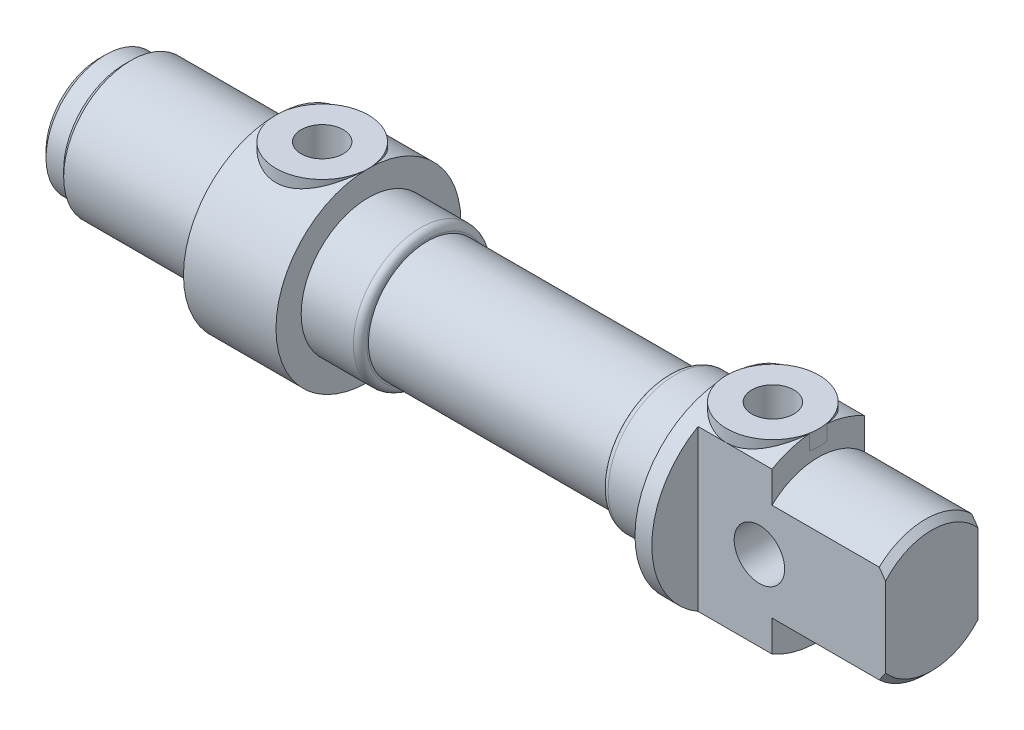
ISO-10303-21;
HEADER;
FILE_DESCRIPTION(('STEP AP214'),'2;1');
FILE_NAME('part.step','',(''),(''),'','','');
FILE_SCHEMA(('AUTOMOTIVE_DESIGN { 1 0 10303 214 1 1 1 1 }'));
ENDSEC;
DATA;
#1=APPLICATION_CONTEXT('core data for automotive mechanical design processes');
#2=APPLICATION_PROTOCOL_DEFINITION('international standard','automotive_design',2000,#1);
#3=PRODUCT_CONTEXT('',#1,'mechanical');
#4=PRODUCT('Part','Part','',(#3));
#5=PRODUCT_RELATED_PRODUCT_CATEGORY('part','',(#4));
#6=PRODUCT_DEFINITION_FORMATION('','',#4);
#7=PRODUCT_DEFINITION_CONTEXT('part definition',#1,'design');
#8=PRODUCT_DEFINITION('design','',#6,#7);
#9=PRODUCT_DEFINITION_SHAPE('','',#8);
#10=(LENGTH_UNIT() NAMED_UNIT(*) SI_UNIT(.MILLI.,.METRE.));
#11=(NAMED_UNIT(*) PLANE_ANGLE_UNIT() SI_UNIT($,.RADIAN.));
#12=(NAMED_UNIT(*) SI_UNIT($,.STERADIAN.) SOLID_ANGLE_UNIT());
#13=UNCERTAINTY_MEASURE_WITH_UNIT(LENGTH_MEASURE(1.E-05),#10,'distance_accuracy_value','');
#14=(GEOMETRIC_REPRESENTATION_CONTEXT(3) GLOBAL_UNCERTAINTY_ASSIGNED_CONTEXT((#13)) GLOBAL_UNIT_ASSIGNED_CONTEXT((#10,
#11,#12)) REPRESENTATION_CONTEXT('',''));
#15=CARTESIAN_POINT('',(0.,0.,0.));
#16=DIRECTION('',(0.,0.,1.));
#17=DIRECTION('',(1.,0.,0.));
#18=AXIS2_PLACEMENT_3D('',#15,#16,#17);
#19=CARTESIAN_POINT('',(-20.3004608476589,0.0420480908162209,1.93135489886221E-05));
#20=DIRECTION('',(-1.,0.,0.));
#21=DIRECTION('',(0.,0.,1.));
#22=AXIS2_PLACEMENT_3D('',#19,#20,#21);
#23=CYLINDRICAL_SURFACE('',#22,19.25);
#24=CARTESIAN_POINT('',(73.6745391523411,0.0420480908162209,1.93135489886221E-05));
#25=DIRECTION('',(-1.,0.,0.));
#26=DIRECTION('',(0.,0.,1.));
#27=AXIS2_PLACEMENT_3D('',#24,#25,#26);
#28=CIRCLE('',#27,19.25);
#29=CARTESIAN_POINT('',(73.6745391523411,19.2051473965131,-1.82703432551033));
#30=VERTEX_POINT('',#29);
#31=CARTESIAN_POINT('',(73.6745391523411,19.2051473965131,1.82707295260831));
#32=VERTEX_POINT('',#31);
#33=EDGE_CURVE('E278',#30,#32,#28,.T.);
#34=ORIENTED_EDGE('',*,*,#33,.F.);
#35=CARTESIAN_POINT('',(73.6745391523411,19.2051473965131,-1.82703432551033));
#36=CARTESIAN_POINT('',(73.7251018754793,19.1802389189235,-2.08875426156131));
#37=CARTESIAN_POINT('',(73.7865025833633,19.1500863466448,-2.34781612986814));
#38=CARTESIAN_POINT('',(73.9300435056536,19.0803366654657,-2.85865558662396));
#39=CARTESIAN_POINT('',(74.0121706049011,19.0407455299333,-3.11043766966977));
#40=CARTESIAN_POINT('',(74.1958845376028,18.9533231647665,-3.60398451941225));
#41=CARTESIAN_POINT('',(74.2973832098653,18.9055293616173,-3.84578885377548));
#42=CARTESIAN_POINT('',(74.5190767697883,18.8028100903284,-4.31911699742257));
#43=CARTESIAN_POINT('',(74.6392742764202,18.7478836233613,-4.55063936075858));
#44=CARTESIAN_POINT('',(74.8970079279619,18.632392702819,-5.00154410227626));
#45=CARTESIAN_POINT('',(75.0345011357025,18.5718423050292,-5.22095467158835));
#46=CARTESIAN_POINT('',(75.3260944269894,18.4464031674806,-5.64724557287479));
#47=CARTESIAN_POINT('',(75.4802006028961,18.381512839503,-5.85412126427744));
#48=CARTESIAN_POINT('',(75.8042071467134,18.2488398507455,-6.25456156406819));
#49=CARTESIAN_POINT('',(75.974126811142,18.1810537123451,-6.44810939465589));
#50=CARTESIAN_POINT('',(76.3286603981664,18.0442452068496,-6.82074283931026));
#51=CARTESIAN_POINT('',(76.5132737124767,17.9752228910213,-6.9998290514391));
#52=CARTESIAN_POINT('',(76.9096524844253,17.8327801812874,-7.35466615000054));
#53=CARTESIAN_POINT('',(77.122413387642,17.7593878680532,-7.52931828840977));
#54=CARTESIAN_POINT('',(77.5626590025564,17.6151281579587,-7.86012869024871));
#55=CARTESIAN_POINT('',(77.7901434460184,17.5442607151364,-8.01628729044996));
#56=CARTESIAN_POINT('',(78.2586839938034,17.4071929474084,-8.30903417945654));
#57=CARTESIAN_POINT('',(78.4997383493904,17.3409920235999,-8.4456249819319));
#58=CARTESIAN_POINT('',(78.9941950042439,17.2154128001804,-8.69813809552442));
#59=CARTESIAN_POINT('',(79.2475984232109,17.1560351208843,-8.81405852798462));
#60=CARTESIAN_POINT('',(79.7628315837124,17.0467586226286,-9.02306847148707));
#61=CARTESIAN_POINT('',(80.0245625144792,16.9967777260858,-9.1163579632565));
#62=CARTESIAN_POINT('',(80.5566810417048,16.9076060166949,-9.28029195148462));
#63=CARTESIAN_POINT('',(80.8270638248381,16.8684093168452,-9.35094880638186));
#64=CARTESIAN_POINT('',(81.3741757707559,16.802477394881,-9.46861675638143));
#65=CARTESIAN_POINT('',(81.6508988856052,16.7757307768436,-9.51564947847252));
#66=CARTESIAN_POINT('',(82.2083546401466,16.7358804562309,-9.58539138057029));
#67=CARTESIAN_POINT('',(82.4890866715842,16.7227747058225,-9.60810421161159));
#68=CARTESIAN_POINT('',(83.0164247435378,16.7115713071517,-9.62752318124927));
#69=CARTESIAN_POINT('',(83.2628936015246,16.711797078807,-9.62713452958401));
#70=CARTESIAN_POINT('',(83.7548093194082,16.7231354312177,-9.60747568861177));
#71=CARTESIAN_POINT('',(84.0002562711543,16.7342470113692,-9.58820723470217));
#72=CARTESIAN_POINT('',(84.4882868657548,16.7669511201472,-9.53104537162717));
#73=CARTESIAN_POINT('',(84.7308701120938,16.7885450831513,-9.49314941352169));
#74=CARTESIAN_POINT('',(85.211409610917,16.841448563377,-9.39921157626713));
#75=CARTESIAN_POINT('',(85.449365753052,16.8727583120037,-9.34316926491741));
#76=CARTESIAN_POINT('',(85.9113469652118,16.9428698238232,-9.21571876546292));
#77=CARTESIAN_POINT('',(86.1355724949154,16.981389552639,-9.14488008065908));
#78=CARTESIAN_POINT('',(86.5771249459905,17.0654195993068,-8.98748675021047));
#79=CARTESIAN_POINT('',(86.7944494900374,17.1109322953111,-8.90092675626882));
#80=CARTESIAN_POINT('',(87.4343994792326,17.2561242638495,-8.61873497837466));
#81=CARTESIAN_POINT('',(87.8452911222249,17.364503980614,-8.40051049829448));
#82=CARTESIAN_POINT('',(88.6733964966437,17.6072758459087,-7.88135489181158));
#83=CARTESIAN_POINT('',(89.0860318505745,17.7432242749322,-7.57384674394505));
#84=CARTESIAN_POINT('',(89.6639811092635,17.9488553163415,-7.06696037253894));
#85=CARTESIAN_POINT('',(89.8499319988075,18.0177407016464,-6.89023115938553));
#86=CARTESIAN_POINT('',(90.2073867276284,18.1545114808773,-6.5222242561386));
#87=CARTESIAN_POINT('',(90.3788884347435,18.2223967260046,-6.33094442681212));
#88=CARTESIAN_POINT('',(90.7210438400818,18.3614965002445,-5.9170846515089));
#89=CARTESIAN_POINT('',(90.890261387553,18.432468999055,-5.69323431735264));
#90=CARTESIAN_POINT('',(91.2090770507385,18.5693498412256,-5.23063449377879));
#91=CARTESIAN_POINT('',(91.358682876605,18.6352601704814,-4.99189091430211));
#92=CARTESIAN_POINT('',(91.6368128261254,18.7600943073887,-4.50122612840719));
#93=CARTESIAN_POINT('',(91.7653719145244,18.8190296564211,-4.24932771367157));
#94=CARTESIAN_POINT('',(92.0003355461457,18.9283085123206,-3.73375354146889));
#95=CARTESIAN_POINT('',(92.1067527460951,18.9786569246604,-3.47008461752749));
#96=CARTESIAN_POINT('',(92.2802092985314,19.0616000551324,-2.97828769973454));
#97=CARTESIAN_POINT('',(92.3508647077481,19.0957572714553,-2.75169314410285));
#98=CARTESIAN_POINT('',(92.4754036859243,19.1563817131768,-2.29311790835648));
#99=CARTESIAN_POINT('',(92.5292992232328,19.182854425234,-2.06114119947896));
#100=CARTESIAN_POINT('',(92.5745391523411,19.2051473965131,-1.82703432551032));
#101=B_SPLINE_CURVE_WITH_KNOTS('',3,(#35,#36,#37,#38,#39,#40,#41,#42,#43,#44,#45,#46,#47,#48,
#49,#50,#51,#52,#53,#54,#55,#56,#57,#58,#59,#60,#61,#62,#63,#64,#65,#66,#67,#68,#69,#70,#71,#72,
#73,#74,#75,#76,#77,#78,#79,#80,#81,#82,#83,#84,#85,#86,#87,#88,#89,#90,#91,#92,#93,#94,#95,#96,
#97,#98,#99,#100),.UNSPECIFIED.,.F.,.F.,(4,2,2,2,2,2,2,2,2,2,2,2,2,2,2,2,2,2,2,2,2,2,2,2,2,2,2,
2,2,2,2,2,4),(0.,0.802789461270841,1.60507220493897,2.40378721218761,3.20261418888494,
3.99949580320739,4.79667065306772,5.5948313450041,6.39295901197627,7.24661058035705,
8.10024660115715,8.95377286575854,9.80737666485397,10.6531377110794,11.4984361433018,
12.3429593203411,13.1873556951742,13.9258176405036,14.6642117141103,15.4027068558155,
16.1412195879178,16.8553072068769,17.5696382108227,18.9973963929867,20.5872498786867,
21.3834785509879,22.179824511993,23.0471014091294,23.9140363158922,24.7795160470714,
25.6444996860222,26.3631525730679,27.0812910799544),.UNSPECIFIED.);
#102=CARTESIAN_POINT('',(83.1245391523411,16.7130371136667,-9.62498068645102));
#103=VERTEX_POINT('',#102);
#104=EDGE_CURVE('E493',#30,#103,#101,.T.);
#105=ORIENTED_EDGE('',*,*,#104,.T.);
#106=DIRECTION('',(-1.,0.,0.));
#107=VECTOR('',#106,1.);
#108=CARTESIAN_POINT('',(-20.3004608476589,16.7130371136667,-9.62498068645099));
#109=LINE('',#108,#107);
#110=CARTESIAN_POINT('',(77.1745391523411,16.7130371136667,-9.62498068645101));
#111=VERTEX_POINT('',#110);
#112=EDGE_CURVE('E412',#103,#111,#109,.T.);
#113=ORIENTED_EDGE('',*,*,#112,.T.);
#114=CARTESIAN_POINT('',(77.1745391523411,0.0420480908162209,1.93135489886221E-05));
#115=DIRECTION('',(-1.,0.,0.));
#116=DIRECTION('',(0.,0.,1.));
#117=AXIS2_PLACEMENT_3D('',#114,#115,#116);
#118=CIRCLE('',#117,19.25);
#119=CARTESIAN_POINT('',(77.1745391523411,-16.6289409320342,-9.62498068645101));
#120=VERTEX_POINT('',#119);
#121=EDGE_CURVE('E362',#111,#120,#118,.T.);
#122=ORIENTED_EDGE('',*,*,#121,.T.);
#123=DIRECTION('',(-1.,0.,0.));
#124=VECTOR('',#123,1.);
#125=CARTESIAN_POINT('',(-20.3004608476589,-16.6289409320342,-9.62498068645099));
#126=LINE('',#125,#124);
#127=CARTESIAN_POINT('',(92.5745391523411,-16.6289409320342,-9.62498068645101));
#128=VERTEX_POINT('',#127);
#129=EDGE_CURVE('E414',#120,#128,#126,.F.);
#130=ORIENTED_EDGE('',*,*,#129,.T.);
#131=CARTESIAN_POINT('',(92.5745391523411,0.0420480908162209,1.93135489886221E-05));
#132=DIRECTION('',(-1.,0.,0.));
#133=DIRECTION('',(0.,0.,1.));
#134=AXIS2_PLACEMENT_3D('',#131,#132,#133);
#135=CIRCLE('',#134,19.25);
#136=CARTESIAN_POINT('',(92.5745391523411,-16.6289409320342,9.62501931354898));
#137=VERTEX_POINT('',#136);
#138=EDGE_CURVE('E275',#128,#137,#135,.T.);
#139=ORIENTED_EDGE('',*,*,#138,.T.);
#140=DIRECTION('',(-1.,0.,0.));
#141=VECTOR('',#140,1.);
#142=CARTESIAN_POINT('',(-20.3004608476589,-16.6289409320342,9.62501931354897));
#143=LINE('',#142,#141);
#144=CARTESIAN_POINT('',(77.1745391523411,-16.6289409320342,9.62501931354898));
#145=VERTEX_POINT('',#144);
#146=EDGE_CURVE('E395',#137,#145,#143,.T.);
#147=ORIENTED_EDGE('',*,*,#146,.T.);
#148=CARTESIAN_POINT('',(77.1745391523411,0.0420480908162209,1.93135489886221E-05));
#149=DIRECTION('',(-1.,0.,0.));
#150=DIRECTION('',(0.,0.,1.));
#151=AXIS2_PLACEMENT_3D('',#148,#149,#150);
#152=CIRCLE('',#151,19.25);
#153=CARTESIAN_POINT('',(77.1745391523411,16.7130371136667,9.62501931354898));
#154=VERTEX_POINT('',#153);
#155=EDGE_CURVE('E11',#145,#154,#152,.T.);
#156=ORIENTED_EDGE('',*,*,#155,.T.);
#157=DIRECTION('',(-1.,0.,0.));
#158=VECTOR('',#157,1.);
#159=CARTESIAN_POINT('',(-20.3004608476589,16.7130371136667,9.62501931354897));
#160=LINE('',#159,#158);
#161=CARTESIAN_POINT('',(83.1245391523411,16.7130371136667,9.62501931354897));
#162=VERTEX_POINT('',#161);
#163=EDGE_CURVE('E393',#154,#162,#160,.F.);
#164=ORIENTED_EDGE('',*,*,#163,.T.);
#165=CARTESIAN_POINT('',(92.5745391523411,19.2051473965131,1.82707295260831));
#166=CARTESIAN_POINT('',(92.5239764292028,19.1802389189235,2.08879288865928));
#167=CARTESIAN_POINT('',(92.4625757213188,19.1500863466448,2.34785475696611));
#168=CARTESIAN_POINT('',(92.3190347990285,19.0803366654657,2.85869421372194));
#169=CARTESIAN_POINT('',(92.2369076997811,19.0407455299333,3.11047629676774));
#170=CARTESIAN_POINT('',(92.0531937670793,18.9533231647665,3.60402314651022));
#171=CARTESIAN_POINT('',(91.9516950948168,18.9055293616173,3.84582748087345));
#172=CARTESIAN_POINT('',(91.7300015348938,18.8028100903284,4.31915562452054));
#173=CARTESIAN_POINT('',(91.6098040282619,18.7478836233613,4.55067798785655));
#174=CARTESIAN_POINT('',(91.3520703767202,18.632392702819,5.00158272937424));
#175=CARTESIAN_POINT('',(91.2145771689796,18.5718423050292,5.22099329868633));
#176=CARTESIAN_POINT('',(90.9229838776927,18.4464031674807,5.64728419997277));
#177=CARTESIAN_POINT('',(90.768877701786,18.381512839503,5.85415989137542));
#178=CARTESIAN_POINT('',(90.4448711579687,18.2488398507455,6.25460019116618));
#179=CARTESIAN_POINT('',(90.2749514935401,18.1810537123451,6.44814802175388));
#180=CARTESIAN_POINT('',(89.9204179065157,18.0442452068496,6.82078146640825));
#181=CARTESIAN_POINT('',(89.7358045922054,17.9752228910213,6.99986767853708));
#182=CARTESIAN_POINT('',(89.3394258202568,17.8327801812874,7.35470477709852));
#183=CARTESIAN_POINT('',(89.1266649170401,17.7593878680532,7.52935691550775));
#184=CARTESIAN_POINT('',(88.6864193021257,17.6151281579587,7.86016731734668));
#185=CARTESIAN_POINT('',(88.4589348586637,17.5442607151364,8.01632591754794));
#186=CARTESIAN_POINT('',(87.9903943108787,17.4071929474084,8.30907280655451));
#187=CARTESIAN_POINT('',(87.7493399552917,17.3409920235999,8.44566360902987));
#188=CARTESIAN_POINT('',(87.2548833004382,17.2154128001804,8.6981767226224));
#189=CARTESIAN_POINT('',(87.0014798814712,17.1560351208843,8.8140971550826));
#190=CARTESIAN_POINT('',(86.4862467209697,17.0467586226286,9.02310709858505));
#191=CARTESIAN_POINT('',(86.2245157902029,16.9967777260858,9.11639659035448));
#192=CARTESIAN_POINT('',(85.6923972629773,16.9076060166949,9.28033057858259));
#193=CARTESIAN_POINT('',(85.422014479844,16.8684093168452,9.35098743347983));
#194=CARTESIAN_POINT('',(84.8749025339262,16.802477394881,9.4686553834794));
#195=CARTESIAN_POINT('',(84.5981794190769,16.7757307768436,9.51568810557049));
#196=CARTESIAN_POINT('',(84.0407236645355,16.7358804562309,9.58543000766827));
#197=CARTESIAN_POINT('',(83.7599916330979,16.7227747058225,9.60814283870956));
#198=CARTESIAN_POINT('',(83.2326535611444,16.7115713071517,9.62756180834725));
#199=CARTESIAN_POINT('',(82.9861847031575,16.711797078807,9.62717315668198));
#200=CARTESIAN_POINT('',(82.4942689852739,16.7231354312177,9.60751431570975));
#201=CARTESIAN_POINT('',(82.2488220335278,16.7342470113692,9.58824586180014));
#202=CARTESIAN_POINT('',(81.7607914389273,16.7669511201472,9.53108399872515));
#203=CARTESIAN_POINT('',(81.5182081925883,16.7885450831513,9.49318804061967));
#204=CARTESIAN_POINT('',(81.0376686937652,16.841448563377,9.39925020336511));
#205=CARTESIAN_POINT('',(80.7997125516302,16.8727583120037,9.34320789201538));
#206=CARTESIAN_POINT('',(80.3377313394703,16.9428698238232,9.2157573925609));
#207=CARTESIAN_POINT('',(80.1135058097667,16.981389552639,9.14491870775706));
#208=CARTESIAN_POINT('',(79.6719533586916,17.0654195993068,8.98752537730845));
#209=CARTESIAN_POINT('',(79.4546288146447,17.1109322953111,8.9009653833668));
#210=CARTESIAN_POINT('',(78.8146788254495,17.2561242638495,8.61877360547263));
#211=CARTESIAN_POINT('',(78.4037871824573,17.364503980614,8.40054912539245));
#212=CARTESIAN_POINT('',(77.5756818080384,17.6072758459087,7.88139351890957));
#213=CARTESIAN_POINT('',(77.1630464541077,17.7432242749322,7.57388537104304));
#214=CARTESIAN_POINT('',(76.5850971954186,17.9488553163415,7.06699899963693));
#215=CARTESIAN_POINT('',(76.3991463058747,18.0177407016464,6.89026978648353));
#216=CARTESIAN_POINT('',(76.0416915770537,18.1545114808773,6.52226288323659));
#217=CARTESIAN_POINT('',(75.8701898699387,18.2223967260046,6.3309830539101));
#218=CARTESIAN_POINT('',(75.5280344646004,18.3614965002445,5.91712327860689));
#219=CARTESIAN_POINT('',(75.3588169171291,18.432468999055,5.69327294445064));
#220=CARTESIAN_POINT('',(75.0400012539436,18.5693498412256,5.23067312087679));
#221=CARTESIAN_POINT('',(74.8903954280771,18.6352601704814,4.9919295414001));
#222=CARTESIAN_POINT('',(74.6122654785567,18.7600943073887,4.50126475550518));
#223=CARTESIAN_POINT('',(74.4837063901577,18.8190296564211,4.24936634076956));
#224=CARTESIAN_POINT('',(74.2487427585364,18.9283085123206,3.73379216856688));
#225=CARTESIAN_POINT('',(74.142325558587,18.9786569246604,3.47012324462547));
#226=CARTESIAN_POINT('',(73.9688690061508,19.0616000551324,2.97832632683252));
#227=CARTESIAN_POINT('',(73.898213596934,19.0957572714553,2.75173177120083));
#228=CARTESIAN_POINT('',(73.7736746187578,19.1563817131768,2.29315653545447));
#229=CARTESIAN_POINT('',(73.7197790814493,19.182854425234,2.06117982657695));
#230=CARTESIAN_POINT('',(73.6745391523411,19.2051473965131,1.82707295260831));
#231=B_SPLINE_CURVE_WITH_KNOTS('',3,(#165,#166,#167,#168,#169,#170,#171,#172,#173,#174,#175,
#176,#177,#178,#179,#180,#181,#182,#183,#184,#185,#186,#187,#188,#189,#190,#191,#192,#193,#194,
#195,#196,#197,#198,#199,#200,#201,#202,#203,#204,#205,#206,#207,#208,#209,#210,#211,#212,#213,
#214,#215,#216,#217,#218,#219,#220,#221,#222,#223,#224,#225,#226,#227,#228,#229,#230),
.UNSPECIFIED.,.F.,.F.,(4,2,2,2,2,2,2,2,2,2,2,2,2,2,2,2,2,2,2,2,2,2,2,2,2,2,2,2,2,2,2,2,4),(0.,
0.802789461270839,1.60507220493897,2.40378721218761,3.20261418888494,3.99949580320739,
4.79667065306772,5.59483134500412,6.39295901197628,7.24661058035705,8.10024660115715,
8.95377286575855,9.80737666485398,10.6531377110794,11.4984361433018,12.3429593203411,
13.1873556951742,13.9258176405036,14.6642117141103,15.4027068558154,16.1412195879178,
16.8553072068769,17.5696382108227,18.9973963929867,20.5872498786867,21.3834785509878,
22.179824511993,23.0471014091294,23.9140363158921,24.7795160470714,25.6444996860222,
26.3631525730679,27.0812910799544),.UNSPECIFIED.);
#232=EDGE_CURVE('E41',#162,#32,#231,.T.);
#233=ORIENTED_EDGE('',*,*,#232,.T.);
#234=EDGE_LOOP('',(#34,#105,#113,#122,#130,#139,#147,#156,#164,#233));
#235=FACE_BOUND('',#234,.T.);
#236=ADVANCED_FACE('F26',(#235),#23,.T.);
#237=CARTESIAN_POINT('',(92.5745391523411,16.7130371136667,-9.62498068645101));
#238=VERTEX_POINT('',#237);
#239=EDGE_CURVE('E385',#238,#103,#109,.T.);
#240=ORIENTED_EDGE('',*,*,#239,.T.);
#241=CARTESIAN_POINT('',(92.5745391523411,19.2051473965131,-1.82703432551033));
#242=VERTEX_POINT('',#241);
#243=EDGE_CURVE('E422',#103,#242,#101,.T.);
#244=ORIENTED_EDGE('',*,*,#243,.T.);
#245=EDGE_CURVE('E276',#242,#238,#135,.T.);
#246=ORIENTED_EDGE('',*,*,#245,.T.);
#247=EDGE_LOOP('',(#240,#244,#246));
#248=FACE_BOUND('',#247,.T.);
#249=ADVANCED_FACE('F242',(#248),#23,.T.);
#250=CARTESIAN_POINT('',(-20.3004608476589,0.0420480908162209,1.93135489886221E-05));
#251=DIRECTION('',(-1.,0.,0.));
#252=DIRECTION('',(0.,0.,1.));
#253=AXIS2_PLACEMENT_3D('',#250,#251,#252);
#254=CYLINDRICAL_SURFACE('',#253,19.25);
#255=CARTESIAN_POINT('',(-20.3004608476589,0.0420480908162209,1.93135489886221E-05));
#256=DIRECTION('',(-1.,0.,0.));
#257=DIRECTION('',(0.,0.,1.));
#258=AXIS2_PLACEMENT_3D('',#255,#256,#257);
#259=CIRCLE('',#258,19.25);
#260=CARTESIAN_POINT('',(-20.3004608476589,19.2920480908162,1.93135489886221E-05));
#261=VERTEX_POINT('',#260);
#262=EDGE_CURVE('E144',#261,#261,#259,.T.);
#263=ORIENTED_EDGE('',*,*,#262,.F.);
#264=CARTESIAN_POINT('',(-10.6754608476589,16.7130371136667,9.62501931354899));
#265=CARTESIAN_POINT('',(-10.4245726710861,16.713038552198,9.62501823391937));
#266=CARTESIAN_POINT('',(-10.1736626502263,16.7187200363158,9.61519664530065));
#267=CARTESIAN_POINT('',(-9.67377605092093,16.7412351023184,9.57603889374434));
#268=CARTESIAN_POINT('',(-9.42480042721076,16.7580738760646,9.54669364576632));
#269=CARTESIAN_POINT('',(-8.93042603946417,16.802307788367,9.46882052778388));
#270=CARTESIAN_POINT('',(-8.68503351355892,16.829719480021,9.42026257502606));
#271=CARTESIAN_POINT('',(-8.19986321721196,16.8941281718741,9.3045489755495));
#272=CARTESIAN_POINT('',(-7.96008793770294,16.9311293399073,9.23738524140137));
#273=CARTESIAN_POINT('',(-7.48912992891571,17.0132327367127,9.08565515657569));
#274=CARTESIAN_POINT('',(-7.25790548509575,17.0582868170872,9.00119182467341));
#275=CARTESIAN_POINT('',(-6.80375240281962,17.1552814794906,8.81538780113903));
#276=CARTESIAN_POINT('',(-6.58082680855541,17.2072245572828,8.71404098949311));
#277=CARTESIAN_POINT('',(-6.14444841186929,17.3165185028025,8.49531845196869));
#278=CARTESIAN_POINT('',(-5.93099339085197,17.3738680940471,8.37794650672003));
#279=CARTESIAN_POINT('',(-5.51438217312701,17.492513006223,8.12792914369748));
#280=CARTESIAN_POINT('',(-5.3112263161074,17.5538084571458,7.99528322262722));
#281=CARTESIAN_POINT('',(-4.89965471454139,17.6840608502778,7.70387621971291));
#282=CARTESIAN_POINT('',(-4.69219268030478,17.7532322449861,7.54386272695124));
#283=CARTESIAN_POINT('',(-4.29126097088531,17.892665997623,7.20772612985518));
#284=CARTESIAN_POINT('',(-4.09778771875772,17.9629280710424,7.03160716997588));
#285=CARTESIAN_POINT('',(-3.72558954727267,18.1028573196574,6.66397970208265));
#286=CARTESIAN_POINT('',(-3.54687297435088,18.172524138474,6.4724626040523));
#287=CARTESIAN_POINT('',(-3.20524723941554,18.3095459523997,6.07498592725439));
#288=CARTESIAN_POINT('',(-3.0423404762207,18.3769005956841,5.86902416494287));
#289=CARTESIAN_POINT('',(-2.72289530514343,18.5121003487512,5.42920946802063));
#290=CARTESIAN_POINT('',(-2.56753634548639,18.5796694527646,5.19441228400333));
#291=CARTESIAN_POINT('',(-2.27738401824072,18.7083993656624,4.71089867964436));
#292=CARTESIAN_POINT('',(-2.1425818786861,18.7695629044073,4.46218825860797));
#293=CARTESIAN_POINT('',(-1.89481502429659,18.8837446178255,3.95238299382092));
#294=CARTESIAN_POINT('',(-1.78184499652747,18.9367647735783,3.69129118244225));
#295=CARTESIAN_POINT('',(-1.57900522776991,19.0330829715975,3.15855243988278));
#296=CARTESIAN_POINT('',(-1.48913303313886,19.0763820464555,2.88690663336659));
#297=CARTESIAN_POINT('',(-1.33918315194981,19.1492189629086,2.35488737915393));
#298=CARTESIAN_POINT('',(-1.27744077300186,19.1795166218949,2.09508669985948));
#299=CARTESIAN_POINT('',(-1.17565257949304,19.2297072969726,1.57027373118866));
#300=CARTESIAN_POINT('',(-1.13560582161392,19.2496007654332,1.30526166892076));
#301=CARTESIAN_POINT('',(-1.07775752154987,19.2783979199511,0.772362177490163));
#302=CARTESIAN_POINT('',(-1.05994464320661,19.2873072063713,0.504476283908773));
#303=CARTESIAN_POINT('',(-1.04677579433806,19.2938899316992,-0.0319781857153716));
#304=CARTESIAN_POINT('',(-1.0514184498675,19.2915640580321,-0.300546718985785));
#305=CARTESIAN_POINT('',(-1.08170740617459,19.2764400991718,-0.812682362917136));
#306=CARTESIAN_POINT('',(-1.10548942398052,19.2645716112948,-1.05638998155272));
#307=CARTESIAN_POINT('',(-1.17143037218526,19.2318279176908,-1.54067584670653));
#308=CARTESIAN_POINT('',(-1.21358800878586,19.210953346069,-1.78125431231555));
#309=CARTESIAN_POINT('',(-1.31582172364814,19.1606971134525,-2.25766576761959));
#310=CARTESIAN_POINT('',(-1.37589838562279,19.131315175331,-2.49349860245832));
#311=CARTESIAN_POINT('',(-1.51335692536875,19.064729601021,-2.9589277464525));
#312=CARTESIAN_POINT('',(-1.5907394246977,19.0275256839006,-3.18852383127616));
#313=CARTESIAN_POINT('',(-1.76326145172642,18.9455749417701,-3.64322731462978));
#314=CARTESIAN_POINT('',(-1.85862784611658,18.9007325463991,-3.86823141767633));
#315=CARTESIAN_POINT('',(-2.06560016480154,18.8048621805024,-4.30931194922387));
#316=CARTESIAN_POINT('',(-2.17721184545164,18.7538320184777,-4.52538517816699));
#317=CARTESIAN_POINT('',(-2.53513125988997,18.5930903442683,-5.15851806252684));
#318=CARTESIAN_POINT('',(-2.80462827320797,18.47567623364,-5.56076495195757));
#319=CARTESIAN_POINT('',(-3.42691185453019,18.2182896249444,-6.35426625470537));
#320=CARTESIAN_POINT('',(-3.78516349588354,18.0772338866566,-6.74088732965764));
#321=CARTESIAN_POINT('',(-4.36592532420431,17.8661779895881,-7.27318945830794));
#322=CARTESIAN_POINT('',(-4.56690836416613,17.7958620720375,-7.44279322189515));
#323=CARTESIAN_POINT('',(-4.98258392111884,17.6571644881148,-7.76534897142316));
#324=CARTESIAN_POINT('',(-5.19727850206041,17.588783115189,-7.91829844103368));
#325=CARTESIAN_POINT('',(-5.65345705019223,17.4515890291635,-8.21575344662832));
#326=CARTESIAN_POINT('',(-5.89577623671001,17.3830277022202,-8.35909578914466));
#327=CARTESIAN_POINT('',(-6.39334711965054,17.2525328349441,-8.62457280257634));
#328=CARTESIAN_POINT('',(-6.64859293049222,17.1905963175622,-8.74671701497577));
#329=CARTESIAN_POINT('',(-7.17042363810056,17.0756164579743,-8.96857402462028));
#330=CARTESIAN_POINT('',(-7.43700172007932,17.0225678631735,-9.06830008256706));
#331=CARTESIAN_POINT('',(-7.97973299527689,16.9274710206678,-9.24416862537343));
#332=CARTESIAN_POINT('',(-8.25588487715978,16.8854212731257,-9.32031432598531));
#333=CARTESIAN_POINT('',(-8.79329665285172,16.8170030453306,-9.44285697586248));
#334=CARTESIAN_POINT('',(-9.05400388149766,16.7896564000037,-9.49113233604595));
#335=CARTESIAN_POINT('',(-9.57948687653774,16.7469722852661,-9.56606044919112));
#336=CARTESIAN_POINT('',(-9.84426241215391,16.7316341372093,-9.592714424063));
#337=CARTESIAN_POINT('',(-10.3753828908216,16.713626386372,-9.62397699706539));
#338=CARTESIAN_POINT('',(-10.6417267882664,16.7109491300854,-9.62859891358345));
#339=CARTESIAN_POINT('',(-11.1736920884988,16.7183604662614,-9.61575754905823));
#340=CARTESIAN_POINT('',(-11.4393135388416,16.7284481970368,-9.59829575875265));
#341=CARTESIAN_POINT('',(-11.9384243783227,16.7591606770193,-9.54468940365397));
#342=CARTESIAN_POINT('',(-12.1722404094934,16.7785072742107,-9.5108059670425));
#343=CARTESIAN_POINT('',(-12.6359210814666,16.8263288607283,-9.42615603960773));
#344=CARTESIAN_POINT('',(-12.8657843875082,16.8548068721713,-9.37538395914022));
#345=CARTESIAN_POINT('',(-13.3200520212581,16.919998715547,-9.25750793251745));
#346=CARTESIAN_POINT('',(-13.5444570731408,16.9567114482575,-9.19040616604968));
#347=CARTESIAN_POINT('',(-13.9866767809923,17.0373024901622,-9.0405035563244));
#348=CARTESIAN_POINT('',(-14.2044887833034,17.0811836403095,-8.9576964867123));
#349=CARTESIAN_POINT('',(-14.8660300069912,17.2261230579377,-8.67842948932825));
#350=CARTESIAN_POINT('',(-15.2970709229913,17.3373451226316,-8.45651284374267));
#351=CARTESIAN_POINT('',(-16.1182156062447,17.5745982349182,-7.95292935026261));
#352=CARTESIAN_POINT('',(-16.5082981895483,17.7006368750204,-7.67123180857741));
#353=CARTESIAN_POINT('',(-17.0812929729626,17.9003559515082,-7.18878155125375));
#354=CARTESIAN_POINT('',(-17.280322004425,17.9728807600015,-7.00635617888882));
#355=CARTESIAN_POINT('',(-17.6624815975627,18.1171420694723,-6.62530524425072));
#356=CARTESIAN_POINT('',(-17.8456168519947,18.1888787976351,-6.42668449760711));
#357=CARTESIAN_POINT('',(-18.1950830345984,18.32977629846,-6.01405324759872));
#358=CARTESIAN_POINT('',(-18.3614012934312,18.3989351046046,-5.80003134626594));
#359=CARTESIAN_POINT('',(-18.6759052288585,18.5328227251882,-5.35787925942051));
#360=CARTESIAN_POINT('',(-18.8240986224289,18.5975534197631,-5.12975514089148));
#361=CARTESIAN_POINT('',(-19.1049739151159,18.7225814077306,-4.65424769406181));
#362=CARTESIAN_POINT('',(-19.2371348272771,18.7827137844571,-4.40651241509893));
#363=CARTESIAN_POINT('',(-19.4799016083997,18.8948584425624,-3.89890251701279));
#364=CARTESIAN_POINT('',(-19.5905067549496,18.9468704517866,-3.63902749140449));
#365=CARTESIAN_POINT('',(-19.7888270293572,19.0411983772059,-3.10918236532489));
#366=CARTESIAN_POINT('',(-19.8765585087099,19.0835212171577,-2.83921963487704));
#367=CARTESIAN_POINT('',(-20.0280916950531,19.1572040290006,-2.2912055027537));
#368=CARTESIAN_POINT('',(-20.0918962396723,19.1885653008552,-2.01315506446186));
#369=CARTESIAN_POINT('',(-20.1899557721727,19.2369915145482,-1.47723050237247));
#370=CARTESIAN_POINT('',(-20.2263855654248,19.255104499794,-1.21984713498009));
#371=CARTESIAN_POINT('',(-20.2783105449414,19.2809691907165,-0.70246323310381));
#372=CARTESIAN_POINT('',(-20.2938070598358,19.2887215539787,-0.442462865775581));
#373=CARTESIAN_POINT('',(-20.3036625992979,19.293648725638,0.0779586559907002));
#374=CARTESIAN_POINT('',(-20.2980279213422,19.2908266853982,0.338379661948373));
#375=CARTESIAN_POINT('',(-20.2657091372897,19.2746906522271,0.857579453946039));
#376=CARTESIAN_POINT('',(-20.2390256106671,19.2613769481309,1.11635828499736));
#377=CARTESIAN_POINT('',(-20.1674116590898,19.225846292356,1.61317102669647));
#378=CARTESIAN_POINT('',(-20.1238061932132,19.2042771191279,1.85144412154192));
#379=CARTESIAN_POINT('',(-20.0189948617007,19.1528151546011,2.32325259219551));
#380=CARTESIAN_POINT('',(-19.9577829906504,19.1229195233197,2.55678632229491));
#381=CARTESIAN_POINT('',(-19.8183950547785,19.0555013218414,3.01751713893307));
#382=CARTESIAN_POINT('',(-19.7402239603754,19.0179809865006,3.24471606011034));
#383=CARTESIAN_POINT('',(-19.5675840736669,18.9361200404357,3.69165683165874));
#384=CARTESIAN_POINT('',(-19.4731089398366,18.8917767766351,3.91139574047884));
#385=CARTESIAN_POINT('',(-19.2643119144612,18.795216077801,4.35134517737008));
#386=CARTESIAN_POINT('',(-19.1493186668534,18.7427446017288,4.57118112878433));
#387=CARTESIAN_POINT('',(-18.9033286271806,18.6325722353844,5.00042278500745));
#388=CARTESIAN_POINT('',(-18.7723263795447,18.5748695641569,5.20982489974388));
#389=CARTESIAN_POINT('',(-18.495198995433,18.4554818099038,5.61722750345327));
#390=CARTESIAN_POINT('',(-18.3490708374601,18.3937959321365,5.81522570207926));
#391=CARTESIAN_POINT('',(-18.0425561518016,18.2677566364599,6.1989580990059));
#392=CARTESIAN_POINT('',(-17.8821688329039,18.2034030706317,6.3846916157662));
#393=CARTESIAN_POINT('',(-17.5312566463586,18.0668959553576,6.76103392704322));
#394=CARTESIAN_POINT('',(-17.3393214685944,17.9946048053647,6.95028016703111));
#395=CARTESIAN_POINT('',(-16.9402672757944,17.8503349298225,7.31201874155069));
#396=CARTESIAN_POINT('',(-16.7331524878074,17.7783561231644,7.48451570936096));
#397=CARTESIAN_POINT('',(-16.3044810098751,17.636558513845,7.81203452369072));
#398=CARTESIAN_POINT('',(-16.0829101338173,17.5667419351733,7.96703878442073));
#399=CARTESIAN_POINT('',(-15.6265400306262,17.4313430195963,8.25839314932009));
#400=CARTESIAN_POINT('',(-15.3917389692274,17.3657612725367,8.39474065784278));
#401=CARTESIAN_POINT('',(-14.902400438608,17.2388880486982,8.65174721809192));
#402=CARTESIAN_POINT('',(-14.6474718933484,17.1778009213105,8.77176489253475));
#403=CARTESIAN_POINT('',(-14.1264773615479,17.064586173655,8.9895000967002));
#404=CARTESIAN_POINT('',(-13.8604171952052,17.0124539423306,9.08722911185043));
#405=CARTESIAN_POINT('',(-13.3196301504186,16.9193335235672,9.25902969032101));
#406=CARTESIAN_POINT('',(-13.04492760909,16.8783167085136,9.33316211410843));
#407=CARTESIAN_POINT('',(-12.488632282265,16.809082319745,9.45698129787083));
#408=CARTESIAN_POINT('',(-12.2070444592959,16.780855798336,9.50668514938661));
#409=CARTESIAN_POINT('',(-11.7168901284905,16.7442633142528,9.57077861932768));
#410=CARTESIAN_POINT('',(-11.5093243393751,16.732581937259,9.591099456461));
#411=CARTESIAN_POINT('',(-11.0929977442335,16.7169679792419,9.61822070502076));
#412=CARTESIAN_POINT('',(-10.8842368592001,16.7130359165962,9.62502021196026));
#413=CARTESIAN_POINT('',(-10.6754608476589,16.7130371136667,9.62501931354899));
#414=B_SPLINE_CURVE_WITH_KNOTS('',3,(#264,#265,#266,#267,#268,#269,#270,#271,#272,#273,#274,
#275,#276,#277,#278,#279,#280,#281,#282,#283,#284,#285,#286,#287,#288,#289,#290,#291,#292,#293,
#294,#295,#296,#297,#298,#299,#300,#301,#302,#303,#304,#305,#306,#307,#308,#309,#310,#311,#312,
#313,#314,#315,#316,#317,#318,#319,#320,#321,#322,#323,#324,#325,#326,#327,#328,#329,#330,#331,
#332,#333,#334,#335,#336,#337,#338,#339,#340,#341,#342,#343,#344,#345,#346,#347,#348,#349,#350,
#351,#352,#353,#354,#355,#356,#357,#358,#359,#360,#361,#362,#363,#364,#365,#366,#367,#368,#369,
#370,#371,#372,#373,#374,#375,#376,#377,#378,#379,#380,#381,#382,#383,#384,#385,#386,#387,#388,
#389,#390,#391,#392,#393,#394,#395,#396,#397,#398,#399,#400,#401,#402,#403,#404,#405,#406,#407,
#408,#409,#410,#411,#412,#413),.UNSPECIFIED.,.T.,.F.,(4,2,2,2,2,2,2,2,2,2,2,2,2,2,2,2,2,2,2,2,2,
2,2,2,2,2,2,2,2,2,2,2,2,2,2,2,2,2,2,2,2,2,2,2,2,2,2,2,2,2,2,2,2,2,2,2,2,2,2,2,2,2,2,2,2,2,2,2,2,
2,2,2,2,2,4),(0.,0.752448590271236,1.50524756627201,2.25922994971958,3.01354058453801,
3.76348351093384,4.51369887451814,5.26373755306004,6.01380095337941,6.82587504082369,
7.63774074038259,8.45006253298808,9.26250738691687,10.130002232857,10.9971258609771,
11.8640382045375,12.7308584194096,13.5360158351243,14.3411382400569,15.1458499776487,
15.9505124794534,16.6851019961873,17.4196397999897,18.1542015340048,18.8887896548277,
19.6333533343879,20.3781814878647,21.8669538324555,23.4964559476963,24.3124170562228,
25.1285012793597,25.9967070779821,26.8645210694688,27.7318203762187,28.5990013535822,
29.3975043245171,30.1959621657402,30.9939372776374,31.791858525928,32.5021949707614,
33.2127667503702,33.9232437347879,34.6340029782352,36.1199339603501,37.6066297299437,
38.4444973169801,39.2821166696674,40.1203624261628,40.9582500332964,41.8185515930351,
42.6788819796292,43.5385956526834,44.3982073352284,45.1789137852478,45.9595706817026,
46.7399949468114,47.5203977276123,48.2491351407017,48.9781214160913,49.7068943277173,
50.4359513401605,51.1959017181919,51.9561117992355,52.7164740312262,53.4768784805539,
54.3131522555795,55.1491940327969,55.9860689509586,56.8230601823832,57.6868257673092,
58.5501452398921,59.4112196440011,60.2716907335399,60.897797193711,61.5239455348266),.UNSPECIFIED.);
#415=CARTESIAN_POINT('',(-1.05046084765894,19.2920480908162,1.93135489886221E-05));
#416=VERTEX_POINT('',#415);
#417=EDGE_CURVE('E479',#416,#261,#414,.T.);
#418=ORIENTED_EDGE('',*,*,#417,.F.);
#419=CARTESIAN_POINT('',(-1.05046084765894,0.0420480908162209,1.93135489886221E-05));
#420=DIRECTION('',(-1.,0.,0.));
#421=DIRECTION('',(0.,0.,1.));
#422=AXIS2_PLACEMENT_3D('',#419,#420,#421);
#423=CIRCLE('',#422,19.25);
#424=EDGE_CURVE('E139',#416,#416,#423,.T.);
#425=ORIENTED_EDGE('',*,*,#424,.T.);
#426=CARTESIAN_POINT('',(-10.6754608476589,16.7130371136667,9.62501931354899));
#427=CARTESIAN_POINT('',(-10.4245726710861,16.713038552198,9.62501823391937));
#428=CARTESIAN_POINT('',(-10.1736626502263,16.7187200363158,9.61519664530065));
#429=CARTESIAN_POINT('',(-9.67377605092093,16.7412351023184,9.57603889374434));
#430=CARTESIAN_POINT('',(-9.42480042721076,16.7580738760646,9.54669364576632));
#431=CARTESIAN_POINT('',(-8.93042603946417,16.802307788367,9.46882052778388));
#432=CARTESIAN_POINT('',(-8.68503351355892,16.829719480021,9.42026257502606));
#433=CARTESIAN_POINT('',(-8.19986321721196,16.8941281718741,9.3045489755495));
#434=CARTESIAN_POINT('',(-7.96008793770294,16.9311293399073,9.23738524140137));
#435=CARTESIAN_POINT('',(-7.48912992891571,17.0132327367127,9.08565515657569));
#436=CARTESIAN_POINT('',(-7.25790548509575,17.0582868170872,9.00119182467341));
#437=CARTESIAN_POINT('',(-6.80375240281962,17.1552814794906,8.81538780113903));
#438=CARTESIAN_POINT('',(-6.58082680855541,17.2072245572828,8.71404098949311));
#439=CARTESIAN_POINT('',(-6.14444841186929,17.3165185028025,8.49531845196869));
#440=CARTESIAN_POINT('',(-5.93099339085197,17.3738680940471,8.37794650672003));
#441=CARTESIAN_POINT('',(-5.51438217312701,17.492513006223,8.12792914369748));
#442=CARTESIAN_POINT('',(-5.3112263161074,17.5538084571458,7.99528322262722));
#443=CARTESIAN_POINT('',(-4.89965471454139,17.6840608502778,7.70387621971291));
#444=CARTESIAN_POINT('',(-4.69219268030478,17.7532322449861,7.54386272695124));
#445=CARTESIAN_POINT('',(-4.29126097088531,17.892665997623,7.20772612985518));
#446=CARTESIAN_POINT('',(-4.09778771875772,17.9629280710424,7.03160716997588));
#447=CARTESIAN_POINT('',(-3.72558954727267,18.1028573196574,6.66397970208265));
#448=CARTESIAN_POINT('',(-3.54687297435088,18.172524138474,6.4724626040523));
#449=CARTESIAN_POINT('',(-3.20524723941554,18.3095459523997,6.07498592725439));
#450=CARTESIAN_POINT('',(-3.0423404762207,18.3769005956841,5.86902416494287));
#451=CARTESIAN_POINT('',(-2.72289530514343,18.5121003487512,5.42920946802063));
#452=CARTESIAN_POINT('',(-2.56753634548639,18.5796694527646,5.19441228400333));
#453=CARTESIAN_POINT('',(-2.27738401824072,18.7083993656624,4.71089867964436));
#454=CARTESIAN_POINT('',(-2.1425818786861,18.7695629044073,4.46218825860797));
#455=CARTESIAN_POINT('',(-1.89481502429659,18.8837446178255,3.95238299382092));
#456=CARTESIAN_POINT('',(-1.78184499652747,18.9367647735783,3.69129118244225));
#457=CARTESIAN_POINT('',(-1.57900522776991,19.0330829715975,3.15855243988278));
#458=CARTESIAN_POINT('',(-1.48913303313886,19.0763820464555,2.88690663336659));
#459=CARTESIAN_POINT('',(-1.33918315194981,19.1492189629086,2.35488737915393));
#460=CARTESIAN_POINT('',(-1.27744077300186,19.1795166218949,2.09508669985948));
#461=CARTESIAN_POINT('',(-1.17565257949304,19.2297072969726,1.57027373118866));
#462=CARTESIAN_POINT('',(-1.13560582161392,19.2496007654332,1.30526166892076));
#463=CARTESIAN_POINT('',(-1.07775752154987,19.2783979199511,0.772362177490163));
#464=CARTESIAN_POINT('',(-1.05994464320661,19.2873072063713,0.504476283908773));
#465=CARTESIAN_POINT('',(-1.04677579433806,19.2938899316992,-0.0319781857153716));
#466=CARTESIAN_POINT('',(-1.0514184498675,19.2915640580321,-0.300546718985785));
#467=CARTESIAN_POINT('',(-1.08170740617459,19.2764400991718,-0.812682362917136));
#468=CARTESIAN_POINT('',(-1.10548942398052,19.2645716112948,-1.05638998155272));
#469=CARTESIAN_POINT('',(-1.17143037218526,19.2318279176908,-1.54067584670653));
#470=CARTESIAN_POINT('',(-1.21358800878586,19.210953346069,-1.78125431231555));
#471=CARTESIAN_POINT('',(-1.31582172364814,19.1606971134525,-2.25766576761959));
#472=CARTESIAN_POINT('',(-1.37589838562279,19.131315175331,-2.49349860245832));
#473=CARTESIAN_POINT('',(-1.51335692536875,19.064729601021,-2.9589277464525));
#474=CARTESIAN_POINT('',(-1.5907394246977,19.0275256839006,-3.18852383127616));
#475=CARTESIAN_POINT('',(-1.76326145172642,18.9455749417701,-3.64322731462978));
#476=CARTESIAN_POINT('',(-1.85862784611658,18.9007325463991,-3.86823141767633));
#477=CARTESIAN_POINT('',(-2.06560016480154,18.8048621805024,-4.30931194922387));
#478=CARTESIAN_POINT('',(-2.17721184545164,18.7538320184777,-4.52538517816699));
#479=CARTESIAN_POINT('',(-2.53513125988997,18.5930903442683,-5.15851806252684));
#480=CARTESIAN_POINT('',(-2.80462827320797,18.47567623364,-5.56076495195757));
#481=CARTESIAN_POINT('',(-3.42691185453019,18.2182896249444,-6.35426625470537));
#482=CARTESIAN_POINT('',(-3.78516349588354,18.0772338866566,-6.74088732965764));
#483=CARTESIAN_POINT('',(-4.36592532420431,17.8661779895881,-7.27318945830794));
#484=CARTESIAN_POINT('',(-4.56690836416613,17.7958620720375,-7.44279322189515));
#485=CARTESIAN_POINT('',(-4.98258392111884,17.6571644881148,-7.76534897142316));
#486=CARTESIAN_POINT('',(-5.19727850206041,17.588783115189,-7.91829844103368));
#487=CARTESIAN_POINT('',(-5.65345705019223,17.4515890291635,-8.21575344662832));
#488=CARTESIAN_POINT('',(-5.89577623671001,17.3830277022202,-8.35909578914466));
#489=CARTESIAN_POINT('',(-6.39334711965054,17.2525328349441,-8.62457280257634));
#490=CARTESIAN_POINT('',(-6.64859293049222,17.1905963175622,-8.74671701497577));
#491=CARTESIAN_POINT('',(-7.17042363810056,17.0756164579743,-8.96857402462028));
#492=CARTESIAN_POINT('',(-7.43700172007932,17.0225678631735,-9.06830008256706));
#493=CARTESIAN_POINT('',(-7.97973299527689,16.9274710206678,-9.24416862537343));
#494=CARTESIAN_POINT('',(-8.25588487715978,16.8854212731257,-9.32031432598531));
#495=CARTESIAN_POINT('',(-8.79329665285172,16.8170030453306,-9.44285697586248));
#496=CARTESIAN_POINT('',(-9.05400388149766,16.7896564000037,-9.49113233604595));
#497=CARTESIAN_POINT('',(-9.57948687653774,16.7469722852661,-9.56606044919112));
#498=CARTESIAN_POINT('',(-9.84426241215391,16.7316341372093,-9.592714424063));
#499=CARTESIAN_POINT('',(-10.3753828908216,16.713626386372,-9.62397699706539));
#500=CARTESIAN_POINT('',(-10.6417267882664,16.7109491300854,-9.62859891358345));
#501=CARTESIAN_POINT('',(-11.1736920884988,16.7183604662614,-9.61575754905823));
#502=CARTESIAN_POINT('',(-11.4393135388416,16.7284481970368,-9.59829575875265));
#503=CARTESIAN_POINT('',(-11.9384243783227,16.7591606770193,-9.54468940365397));
#504=CARTESIAN_POINT('',(-12.1722404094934,16.7785072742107,-9.5108059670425));
#505=CARTESIAN_POINT('',(-12.6359210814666,16.8263288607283,-9.42615603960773));
#506=CARTESIAN_POINT('',(-12.8657843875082,16.8548068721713,-9.37538395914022));
#507=CARTESIAN_POINT('',(-13.3200520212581,16.919998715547,-9.25750793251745));
#508=CARTESIAN_POINT('',(-13.5444570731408,16.9567114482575,-9.19040616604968));
#509=CARTESIAN_POINT('',(-13.9866767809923,17.0373024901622,-9.0405035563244));
#510=CARTESIAN_POINT('',(-14.2044887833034,17.0811836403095,-8.9576964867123));
#511=CARTESIAN_POINT('',(-14.8660300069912,17.2261230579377,-8.67842948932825));
#512=CARTESIAN_POINT('',(-15.2970709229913,17.3373451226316,-8.45651284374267));
#513=CARTESIAN_POINT('',(-16.1182156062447,17.5745982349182,-7.95292935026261));
#514=CARTESIAN_POINT('',(-16.5082981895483,17.7006368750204,-7.67123180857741));
#515=CARTESIAN_POINT('',(-17.0812929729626,17.9003559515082,-7.18878155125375));
#516=CARTESIAN_POINT('',(-17.280322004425,17.9728807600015,-7.00635617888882));
#517=CARTESIAN_POINT('',(-17.6624815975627,18.1171420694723,-6.62530524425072));
#518=CARTESIAN_POINT('',(-17.8456168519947,18.1888787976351,-6.42668449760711));
#519=CARTESIAN_POINT('',(-18.1950830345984,18.32977629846,-6.01405324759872));
#520=CARTESIAN_POINT('',(-18.3614012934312,18.3989351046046,-5.80003134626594));
#521=CARTESIAN_POINT('',(-18.6759052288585,18.5328227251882,-5.35787925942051));
#522=CARTESIAN_POINT('',(-18.8240986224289,18.5975534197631,-5.12975514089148));
#523=CARTESIAN_POINT('',(-19.1049739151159,18.7225814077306,-4.65424769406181));
#524=CARTESIAN_POINT('',(-19.2371348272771,18.7827137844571,-4.40651241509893));
#525=CARTESIAN_POINT('',(-19.4799016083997,18.8948584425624,-3.89890251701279));
#526=CARTESIAN_POINT('',(-19.5905067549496,18.9468704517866,-3.63902749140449));
#527=CARTESIAN_POINT('',(-19.7888270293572,19.0411983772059,-3.10918236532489));
#528=CARTESIAN_POINT('',(-19.8765585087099,19.0835212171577,-2.83921963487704));
#529=CARTESIAN_POINT('',(-20.0280916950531,19.1572040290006,-2.2912055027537));
#530=CARTESIAN_POINT('',(-20.0918962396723,19.1885653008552,-2.01315506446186));
#531=CARTESIAN_POINT('',(-20.1899557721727,19.2369915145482,-1.47723050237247));
#532=CARTESIAN_POINT('',(-20.2263855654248,19.255104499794,-1.21984713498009));
#533=CARTESIAN_POINT('',(-20.2783105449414,19.2809691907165,-0.70246323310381));
#534=CARTESIAN_POINT('',(-20.2938070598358,19.2887215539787,-0.442462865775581));
#535=CARTESIAN_POINT('',(-20.3036625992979,19.293648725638,0.0779586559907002));
#536=CARTESIAN_POINT('',(-20.2980279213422,19.2908266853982,0.338379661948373));
#537=CARTESIAN_POINT('',(-20.2657091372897,19.2746906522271,0.857579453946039));
#538=CARTESIAN_POINT('',(-20.2390256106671,19.2613769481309,1.11635828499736));
#539=CARTESIAN_POINT('',(-20.1674116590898,19.225846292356,1.61317102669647));
#540=CARTESIAN_POINT('',(-20.1238061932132,19.2042771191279,1.85144412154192));
#541=CARTESIAN_POINT('',(-20.0189948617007,19.1528151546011,2.32325259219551));
#542=CARTESIAN_POINT('',(-19.9577829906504,19.1229195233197,2.55678632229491));
#543=CARTESIAN_POINT('',(-19.8183950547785,19.0555013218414,3.01751713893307));
#544=CARTESIAN_POINT('',(-19.7402239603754,19.0179809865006,3.24471606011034));
#545=CARTESIAN_POINT('',(-19.5675840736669,18.9361200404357,3.69165683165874));
#546=CARTESIAN_POINT('',(-19.4731089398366,18.8917767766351,3.91139574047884));
#547=CARTESIAN_POINT('',(-19.2643119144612,18.795216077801,4.35134517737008));
#548=CARTESIAN_POINT('',(-19.1493186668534,18.7427446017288,4.57118112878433));
#549=CARTESIAN_POINT('',(-18.9033286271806,18.6325722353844,5.00042278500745));
#550=CARTESIAN_POINT('',(-18.7723263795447,18.5748695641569,5.20982489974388));
#551=CARTESIAN_POINT('',(-18.495198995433,18.4554818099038,5.61722750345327));
#552=CARTESIAN_POINT('',(-18.3490708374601,18.3937959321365,5.81522570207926));
#553=CARTESIAN_POINT('',(-18.0425561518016,18.2677566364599,6.1989580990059));
#554=CARTESIAN_POINT('',(-17.8821688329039,18.2034030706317,6.3846916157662));
#555=CARTESIAN_POINT('',(-17.5312566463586,18.0668959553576,6.76103392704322));
#556=CARTESIAN_POINT('',(-17.3393214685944,17.9946048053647,6.95028016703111));
#557=CARTESIAN_POINT('',(-16.9402672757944,17.8503349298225,7.31201874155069));
#558=CARTESIAN_POINT('',(-16.7331524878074,17.7783561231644,7.48451570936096));
#559=CARTESIAN_POINT('',(-16.3044810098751,17.636558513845,7.81203452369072));
#560=CARTESIAN_POINT('',(-16.0829101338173,17.5667419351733,7.96703878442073));
#561=CARTESIAN_POINT('',(-15.6265400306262,17.4313430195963,8.25839314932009));
#562=CARTESIAN_POINT('',(-15.3917389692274,17.3657612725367,8.39474065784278));
#563=CARTESIAN_POINT('',(-14.902400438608,17.2388880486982,8.65174721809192));
#564=CARTESIAN_POINT('',(-14.6474718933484,17.1778009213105,8.77176489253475));
#565=CARTESIAN_POINT('',(-14.1264773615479,17.064586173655,8.9895000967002));
#566=CARTESIAN_POINT('',(-13.8604171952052,17.0124539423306,9.08722911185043));
#567=CARTESIAN_POINT('',(-13.3196301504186,16.9193335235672,9.25902969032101));
#568=CARTESIAN_POINT('',(-13.04492760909,16.8783167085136,9.33316211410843));
#569=CARTESIAN_POINT('',(-12.488632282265,16.809082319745,9.45698129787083));
#570=CARTESIAN_POINT('',(-12.2070444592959,16.780855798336,9.50668514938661));
#571=CARTESIAN_POINT('',(-11.7168901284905,16.7442633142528,9.57077861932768));
#572=CARTESIAN_POINT('',(-11.5093243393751,16.732581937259,9.591099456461));
#573=CARTESIAN_POINT('',(-11.0929977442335,16.7169679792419,9.61822070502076));
#574=CARTESIAN_POINT('',(-10.8842368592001,16.7130359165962,9.62502021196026));
#575=CARTESIAN_POINT('',(-10.6754608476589,16.7130371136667,9.62501931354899));
#576=B_SPLINE_CURVE_WITH_KNOTS('',3,(#426,#427,#428,#429,#430,#431,#432,#433,#434,#435,#436,
#437,#438,#439,#440,#441,#442,#443,#444,#445,#446,#447,#448,#449,#450,#451,#452,#453,#454,#455,
#456,#457,#458,#459,#460,#461,#462,#463,#464,#465,#466,#467,#468,#469,#470,#471,#472,#473,#474,
#475,#476,#477,#478,#479,#480,#481,#482,#483,#484,#485,#486,#487,#488,#489,#490,#491,#492,#493,
#494,#495,#496,#497,#498,#499,#500,#501,#502,#503,#504,#505,#506,#507,#508,#509,#510,#511,#512,
#513,#514,#515,#516,#517,#518,#519,#520,#521,#522,#523,#524,#525,#526,#527,#528,#529,#530,#531,
#532,#533,#534,#535,#536,#537,#538,#539,#540,#541,#542,#543,#544,#545,#546,#547,#548,#549,#550,
#551,#552,#553,#554,#555,#556,#557,#558,#559,#560,#561,#562,#563,#564,#565,#566,#567,#568,#569,
#570,#571,#572,#573,#574,#575),.UNSPECIFIED.,.T.,.F.,(4,2,2,2,2,2,2,2,2,2,2,2,2,2,2,2,2,2,2,2,2,
2,2,2,2,2,2,2,2,2,2,2,2,2,2,2,2,2,2,2,2,2,2,2,2,2,2,2,2,2,2,2,2,2,2,2,2,2,2,2,2,2,2,2,2,2,2,2,2,
2,2,2,2,2,4),(0.,0.752448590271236,1.50524756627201,2.25922994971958,3.01354058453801,
3.76348351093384,4.51369887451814,5.26373755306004,6.01380095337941,6.82587504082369,
7.63774074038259,8.45006253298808,9.26250738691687,10.130002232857,10.9971258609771,
11.8640382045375,12.7308584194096,13.5360158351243,14.3411382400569,15.1458499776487,
15.9505124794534,16.6851019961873,17.4196397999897,18.1542015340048,18.8887896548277,
19.6333533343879,20.3781814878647,21.8669538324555,23.4964559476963,24.3124170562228,
25.1285012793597,25.9967070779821,26.8645210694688,27.7318203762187,28.5990013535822,
29.3975043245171,30.1959621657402,30.9939372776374,31.791858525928,32.5021949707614,
33.2127667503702,33.9232437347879,34.6340029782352,36.1199339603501,37.6066297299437,
38.4444973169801,39.2821166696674,40.1203624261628,40.9582500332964,41.8185515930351,
42.6788819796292,43.5385956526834,44.3982073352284,45.1789137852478,45.9595706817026,
46.7399949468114,47.5203977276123,48.2491351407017,48.9781214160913,49.7068943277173,
50.4359513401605,51.1959017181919,51.9561117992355,52.7164740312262,53.4768784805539,
54.3131522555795,55.1491940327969,55.9860689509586,56.8230601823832,57.6868257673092,
58.5501452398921,59.4112196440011,60.2716907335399,60.897797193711,61.5239455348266),.UNSPECIFIED.);
#577=EDGE_CURVE('E444',#261,#416,#576,.T.);
#578=ORIENTED_EDGE('',*,*,#577,.F.);
#579=EDGE_LOOP('',(#263,#418,#425,#578));
#580=FACE_BOUND('',#579,.T.);
#581=ADVANCED_FACE('F247',(#580),#254,.T.);
#582=CARTESIAN_POINT('',(92.5745391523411,19.2920480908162,1.93135489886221E-05));
#583=DIRECTION('',(-1.,0.,0.));
#584=DIRECTION('',(0.,0.,1.));
#585=AXIS2_PLACEMENT_3D('',#582,#583,#584);
#586=PLANE('',#585);
#587=DIRECTION('',(0.,0.,1.));
#588=VECTOR('',#587,1.);
#589=CARTESIAN_POINT('',(92.5745391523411,16.0890889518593,1.9313548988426E-05));
#590=LINE('',#589,#588);
#591=CARTESIAN_POINT('',(92.5745391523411,16.0890889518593,-1.82703432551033));
#592=VERTEX_POINT('',#591);
#593=CARTESIAN_POINT('',(92.5745391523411,16.0890889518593,1.82707295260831));
#594=VERTEX_POINT('',#593);
#595=EDGE_CURVE('E450',#592,#594,#590,.T.);
#596=ORIENTED_EDGE('',*,*,#595,.T.);
#597=DIRECTION('',(0.,1.,0.));
#598=VECTOR('',#597,1.);
#599=CARTESIAN_POINT('',(92.5745391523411,-19.2097019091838,1.8270729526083));
#600=LINE('',#599,#598);
#601=CARTESIAN_POINT('',(92.5745391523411,19.2051473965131,1.82707295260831));
#602=VERTEX_POINT('',#601);
#603=EDGE_CURVE('E521',#594,#602,#600,.T.);
#604=ORIENTED_EDGE('',*,*,#603,.T.);
#605=CARTESIAN_POINT('',(92.5745391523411,16.7130371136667,9.62501931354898));
#606=VERTEX_POINT('',#605);
#607=EDGE_CURVE('E267',#606,#602,#135,.T.);
#608=ORIENTED_EDGE('',*,*,#607,.F.);
#609=DIRECTION('',(0.,-1.,0.));
#610=VECTOR('',#609,1.);
#611=CARTESIAN_POINT('',(92.5745391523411,19.2920480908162,9.62501931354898));
#612=LINE('',#611,#610);
#613=CARTESIAN_POINT('',(92.5745391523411,10.2086293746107,9.62501931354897));
#614=VERTEX_POINT('',#613);
#615=EDGE_CURVE('E397',#606,#614,#612,.T.);
#616=ORIENTED_EDGE('',*,*,#615,.T.);
#617=CARTESIAN_POINT('',(92.5745391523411,0.0420480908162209,1.93135489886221E-05));
#618=DIRECTION('',(-1.,0.,0.));
#619=DIRECTION('',(0.,0.,1.));
#620=AXIS2_PLACEMENT_3D('',#617,#618,#619);
#621=CIRCLE('',#620,14.);
#622=CARTESIAN_POINT('',(92.5745391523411,10.2086293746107,-9.62498068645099));
#623=VERTEX_POINT('',#622);
#624=EDGE_CURVE('E415',#614,#623,#621,.T.);
#625=ORIENTED_EDGE('',*,*,#624,.T.);
#626=DIRECTION('',(0.,1.,0.));
#627=VECTOR('',#626,1.);
#628=CARTESIAN_POINT('',(92.5745391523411,19.2920480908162,-9.62498068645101));
#629=LINE('',#628,#627);
#630=EDGE_CURVE('E409',#623,#238,#629,.T.);
#631=ORIENTED_EDGE('',*,*,#630,.T.);
#632=ORIENTED_EDGE('',*,*,#245,.F.);
#633=DIRECTION('',(0.,1.,0.));
#634=VECTOR('',#633,1.);
#635=CARTESIAN_POINT('',(92.5745391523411,-19.2097019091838,-1.82703432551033));
#636=LINE('',#635,#634);
#637=EDGE_CURVE('E426',#242,#592,#636,.F.);
#638=ORIENTED_EDGE('',*,*,#637,.T.);
#639=EDGE_LOOP('',(#596,#604,#608,#616,#625,#631,#632,#638));
#640=FACE_BOUND('',#639,.T.);
#641=ADVANCED_FACE('F261',(#640),#586,.F.);
#642=CARTESIAN_POINT('',(-20.3004608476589,0.0420480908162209,1.93135489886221E-05));
#643=DIRECTION('',(-1.,0.,0.));
#644=DIRECTION('',(0.,0.,1.));
#645=AXIS2_PLACEMENT_3D('',#642,#643,#644);
#646=CYLINDRICAL_SURFACE('',#645,14.);
#647=CARTESIAN_POINT('',(114.887039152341,0.0420480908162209,1.93135489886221E-05));
#648=DIRECTION('',(-1.,0.,0.));
#649=DIRECTION('',(0.,0.,1.));
#650=AXIS2_PLACEMENT_3D('',#647,#648,#649);
#651=CIRCLE('',#650,14.);
#652=CARTESIAN_POINT('',(114.887039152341,-10.1245331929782,-9.62498068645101));
#653=VERTEX_POINT('',#652);
#654=CARTESIAN_POINT('',(114.887039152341,-10.1245331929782,9.62501931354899));
#655=VERTEX_POINT('',#654);
#656=EDGE_CURVE('E167',#653,#655,#651,.T.);
#657=ORIENTED_EDGE('',*,*,#656,.T.);
#658=DIRECTION('',(-1.,0.,0.));
#659=VECTOR('',#658,1.);
#660=CARTESIAN_POINT('',(-20.3004608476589,-10.1245331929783,9.62501931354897));
#661=LINE('',#660,#659);
#662=CARTESIAN_POINT('',(92.5745391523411,-10.1245331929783,9.62501931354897));
#663=VERTEX_POINT('',#662);
#664=EDGE_CURVE('E389',#655,#663,#661,.T.);
#665=ORIENTED_EDGE('',*,*,#664,.T.);
#666=CARTESIAN_POINT('',(92.5745391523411,-10.1245331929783,-9.62498068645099));
#667=VERTEX_POINT('',#666);
#668=EDGE_CURVE('E279',#667,#663,#621,.T.);
#669=ORIENTED_EDGE('',*,*,#668,.F.);
#670=DIRECTION('',(-1.,0.,0.));
#671=VECTOR('',#670,1.);
#672=CARTESIAN_POINT('',(-20.3004608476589,-10.1245331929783,-9.62498068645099));
#673=LINE('',#672,#671);
#674=EDGE_CURVE('E377',#667,#653,#673,.F.);
#675=ORIENTED_EDGE('',*,*,#674,.T.);
#676=EDGE_LOOP('',(#657,#665,#669,#675));
#677=FACE_BOUND('',#676,.T.);
#678=ADVANCED_FACE('F347',(#677),#646,.T.);
#679=CARTESIAN_POINT('',(114.887039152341,0.0420480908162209,1.93135489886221E-05));
#680=DIRECTION('',(-1.,0.,0.));
#681=DIRECTION('',(0.,0.,1.));
#682=AXIS2_PLACEMENT_3D('',#679,#680,#681);
#683=CONICAL_SURFACE('',#682,14.,0.785398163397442);
#684=CARTESIAN_POINT('',(104.36885825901,-22.5079091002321,9.62501931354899));
#685=CARTESIAN_POINT('',(104.83408391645,-22.0020189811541,9.62501931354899));
#686=CARTESIAN_POINT('',(105.298062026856,-21.4949735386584,9.62501931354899));
#687=CARTESIAN_POINT('',(106.222846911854,-20.4779531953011,9.62501931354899));
#688=CARTESIAN_POINT('',(106.683653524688,-19.9679781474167,9.62501931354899));
#689=CARTESIAN_POINT('',(107.601687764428,-18.9441786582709,9.62501931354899));
#690=CARTESIAN_POINT('',(108.058912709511,-18.4303518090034,9.62501931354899));
#691=CARTESIAN_POINT('',(108.968457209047,-17.3983873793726,9.62501931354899));
#692=CARTESIAN_POINT('',(109.420776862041,-16.8802498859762,9.62501931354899));
#693=CARTESIAN_POINT('',(110.312171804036,-15.8467048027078,9.62501931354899));
#694=CARTESIAN_POINT('',(110.751343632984,-15.3313806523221,9.62501931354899));
#695=CARTESIAN_POINT('',(111.621828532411,-14.2941454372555,9.62501931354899));
#696=CARTESIAN_POINT('',(112.053141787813,-13.772234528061,9.62501931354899));
#697=CARTESIAN_POINT('',(112.905545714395,-12.7197369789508,9.62501931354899));
#698=CARTESIAN_POINT('',(113.326632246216,-12.1891469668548,9.62501931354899));
#699=CARTESIAN_POINT('',(113.947522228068,-11.3849963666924,9.62501931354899));
#700=CARTESIAN_POINT('',(114.152689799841,-11.1155764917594,9.62501931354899));
#701=CARTESIAN_POINT('',(114.558769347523,-10.5735524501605,9.62501931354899));
#702=CARTESIAN_POINT('',(114.759681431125,-10.3009483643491,9.62501931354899));
#703=CARTESIAN_POINT('',(115.159066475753,-9.74843349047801,9.62501931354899));
#704=CARTESIAN_POINT('',(115.357471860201,-9.46847374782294,9.62501931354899));
#705=CARTESIAN_POINT('',(115.747988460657,-8.90420891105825,9.62501931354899));
#706=CARTESIAN_POINT('',(115.94010002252,-8.61990405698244,9.62501931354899));
#707=CARTESIAN_POINT('',(116.316304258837,-8.04679638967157,9.62501931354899));
#708=CARTESIAN_POINT('',(116.500411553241,-7.7580032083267,9.62501931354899));
#709=CARTESIAN_POINT('',(116.85926837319,-7.17456962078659,9.62501931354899));
#710=CARTESIAN_POINT('',(117.034016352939,-6.87992825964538,9.62501931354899));
#711=CARTESIAN_POINT('',(117.373317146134,-6.28143770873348,9.62501931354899));
#712=CARTESIAN_POINT('',(117.537769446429,-5.97753115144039,9.62501931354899));
#713=CARTESIAN_POINT('',(117.851767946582,-5.36225869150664,9.62501931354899));
#714=CARTESIAN_POINT('',(118.001321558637,-5.05089659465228,9.62501931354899));
#715=CARTESIAN_POINT('',(118.282765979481,-4.41787100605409,9.62501931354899));
#716=CARTESIAN_POINT('',(118.414543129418,-4.09615614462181,9.62501931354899));
#717=CARTESIAN_POINT('',(118.654827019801,-3.44355505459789,9.62501931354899));
#718=CARTESIAN_POINT('',(118.763291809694,-3.11265348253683,9.62501931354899));
#719=CARTESIAN_POINT('',(118.857591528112,-2.77738352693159,9.62501931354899));
#720=B_SPLINE_CURVE_WITH_KNOTS('',3,(#684,#685,#686,#687,#688,#689,#690,#691,#692,#693,#694,
#695,#696,#697,#698,#699,#700,#701,#702,#703,#704,#705,#706,#707,#708,#709,#710,#711,#712,#713,
#714,#715,#716,#717,#718,#719),.UNSPECIFIED.,.F.,.F.,(4,2,2,2,2,2,2,2,2,2,2,2,2,2,2,2,2,4),(0.,
2.06185969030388,4.12382377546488,6.18720715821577,8.25054901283,10.2817131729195,
12.3128294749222,14.3447546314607,15.3606583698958,16.3765363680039,17.4058728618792,
18.4351526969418,19.4624659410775,20.4899483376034,21.5262601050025,22.5620536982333,
23.6041842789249,24.6481747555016),.UNSPECIFIED.);
#721=CARTESIAN_POINT('',(116.199539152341,-8.22427099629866,9.62501931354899));
#722=VERTEX_POINT('',#721);
#723=EDGE_CURVE('E34',#655,#722,#720,.T.);
#724=ORIENTED_EDGE('',*,*,#723,.F.);
#725=ORIENTED_EDGE('',*,*,#656,.F.);
#726=CARTESIAN_POINT('',(118.857591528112,-2.77738352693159,-9.62498068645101));
#727=CARTESIAN_POINT('',(118.798206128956,-2.98863090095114,-9.62498068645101));
#728=CARTESIAN_POINT('',(118.733141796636,-3.19821463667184,-9.62498068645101));
#729=CARTESIAN_POINT('',(118.592960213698,-3.61386453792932,-9.62498068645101));
#730=CARTESIAN_POINT('',(118.517848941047,-3.81993271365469,-9.62498068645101));
#731=CARTESIAN_POINT('',(118.359014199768,-4.22807426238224,-9.62498068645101));
#732=CARTESIAN_POINT('',(118.275313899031,-4.43015671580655,-9.62498068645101));
#733=CARTESIAN_POINT('',(118.100254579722,-4.83099845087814,-9.62498068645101));
#734=CARTESIAN_POINT('',(118.008894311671,-5.02975718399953,-9.62498068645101));
#735=CARTESIAN_POINT('',(117.726406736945,-5.6180794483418,-9.62498068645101));
#736=CARTESIAN_POINT('',(117.52555344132,-6.00298399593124,-9.62498068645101));
#737=CARTESIAN_POINT('',(117.104154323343,-6.76202047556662,-9.62498068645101));
#738=CARTESIAN_POINT('',(116.883595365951,-7.13614499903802,-9.62498068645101));
#739=CARTESIAN_POINT('',(116.389936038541,-7.9361649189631,-9.62498068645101));
#740=CARTESIAN_POINT('',(116.114172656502,-8.3604112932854,-9.62498068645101));
#741=CARTESIAN_POINT('',(115.688917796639,-8.98976314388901,-9.62498068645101));
#742=CARTESIAN_POINT('',(115.545004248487,-9.19868876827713,-9.62498068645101));
#743=CARTESIAN_POINT('',(115.253888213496,-9.61425585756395,-9.62498068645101));
#744=CARTESIAN_POINT('',(115.10668556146,-9.82089720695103,-9.62498068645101));
#745=CARTESIAN_POINT('',(114.756305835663,-10.3056192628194,-9.62498068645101));
#746=CARTESIAN_POINT('',(114.551929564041,-10.5828322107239,-9.62498068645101));
#747=CARTESIAN_POINT('',(114.138789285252,-11.13397290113,-9.62498068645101));
#748=CARTESIAN_POINT('',(113.930025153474,-11.4079005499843,-9.62498068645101));
#749=CARTESIAN_POINT('',(113.29816988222,-12.2254832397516,-9.62498068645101));
#750=CARTESIAN_POINT('',(112.869561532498,-12.7648755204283,-9.62498068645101));
#751=CARTESIAN_POINT('',(112.001394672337,-13.8353484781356,-9.62498068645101));
#752=CARTESIAN_POINT('',(111.561828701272,-14.366423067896,-9.62498068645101));
#753=CARTESIAN_POINT('',(110.674664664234,-15.4218332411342,-9.62498068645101));
#754=CARTESIAN_POINT('',(110.227066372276,-15.9461686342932,-9.62498068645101));
#755=CARTESIAN_POINT('',(109.334308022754,-16.9795559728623,-9.62498068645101));
#756=CARTESIAN_POINT('',(108.889264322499,-17.4887086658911,-9.62498068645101));
#757=CARTESIAN_POINT('',(107.994489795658,-18.5028948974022,-9.62498068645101));
#758=CARTESIAN_POINT('',(107.544758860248,-19.0079283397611,-9.62498068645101));
#759=CARTESIAN_POINT('',(106.64238472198,-20.0137087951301,-9.62498068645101));
#760=CARTESIAN_POINT('',(106.189748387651,-20.5144619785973,-9.62498068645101));
#761=CARTESIAN_POINT('',(105.281429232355,-21.5131517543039,-9.62498068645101));
#762=CARTESIAN_POINT('',(104.825746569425,-22.0110884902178,-9.62498068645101));
#763=CARTESIAN_POINT('',(104.36885825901,-22.5079091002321,-9.62498068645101));
#764=B_SPLINE_CURVE_WITH_KNOTS('',3,(#726,#727,#728,#729,#730,#731,#732,#733,#734,#735,#736,
#737,#738,#739,#740,#741,#742,#743,#744,#745,#746,#747,#748,#749,#750,#751,#752,#753,#754,#755,
#756,#757,#758,#759,#760,#761,#762,#763),.UNSPECIFIED.,.F.,.F.,(4,2,2,2,2,2,2,2,2,2,2,2,2,2,2,2,
2,2,4),(0.,0.658133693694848,1.31587752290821,1.971891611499,2.62801291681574,3.92963170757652,
5.23212467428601,6.74963206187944,7.5106961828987,8.2717986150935,9.30496796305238,
10.338166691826,12.4047962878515,14.4728736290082,16.5410092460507,18.5696944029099,
20.5984267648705,22.6234318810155,24.6483327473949),.UNSPECIFIED.);
#765=CARTESIAN_POINT('',(116.199539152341,-8.22427099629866,-9.62498068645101));
#766=VERTEX_POINT('',#765);
#767=EDGE_CURVE('E199',#766,#653,#764,.T.);
#768=ORIENTED_EDGE('',*,*,#767,.F.);
#769=CARTESIAN_POINT('',(116.199539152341,0.0420480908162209,1.93135489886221E-05));
#770=DIRECTION('',(-1.,0.,0.));
#771=DIRECTION('',(0.,0.,1.));
#772=AXIS2_PLACEMENT_3D('',#769,#770,#771);
#773=CIRCLE('',#772,12.6875);
#774=EDGE_CURVE('E170',#722,#766,#773,.F.);
#775=ORIENTED_EDGE('',*,*,#774,.F.);
#776=EDGE_LOOP('',(#724,#725,#768,#775));
#777=FACE_BOUND('',#776,.T.);
#778=ADVANCED_FACE('F238',(#777),#683,.T.);
#779=CARTESIAN_POINT('',(116.199539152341,14.0420480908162,1.93135489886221E-05));
#780=DIRECTION('',(-1.,0.,0.));
#781=DIRECTION('',(0.,0.,1.));
#782=AXIS2_PLACEMENT_3D('',#779,#780,#781);
#783=PLANE('',#782);
#784=CARTESIAN_POINT('',(116.199539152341,8.3083671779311,-9.62498068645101));
#785=VERTEX_POINT('',#784);
#786=CARTESIAN_POINT('',(116.199539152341,8.3083671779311,9.62501931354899));
#787=VERTEX_POINT('',#786);
#788=EDGE_CURVE('E171',#785,#787,#773,.F.);
#789=ORIENTED_EDGE('',*,*,#788,.T.);
#790=DIRECTION('',(0.,1.,0.));
#791=VECTOR('',#790,1.);
#792=CARTESIAN_POINT('',(116.199539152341,-19.2079519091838,9.62501931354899));
#793=LINE('',#792,#791);
#794=EDGE_CURVE('E352',#722,#787,#793,.T.);
#795=ORIENTED_EDGE('',*,*,#794,.F.);
#796=ORIENTED_EDGE('',*,*,#774,.T.);
#797=DIRECTION('',(0.,1.,0.));
#798=VECTOR('',#797,1.);
#799=CARTESIAN_POINT('',(116.199539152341,-19.2079519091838,-9.62498068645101));
#800=LINE('',#799,#798);
#801=EDGE_CURVE('E355',#766,#785,#800,.T.);
#802=ORIENTED_EDGE('',*,*,#801,.T.);
#803=EDGE_LOOP('',(#789,#795,#796,#802));
#804=FACE_BOUND('',#803,.T.);
#805=ADVANCED_FACE('F340',(#804),#783,.F.);
#806=CARTESIAN_POINT('',(-57.050460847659,12.4670480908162,1.93135489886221E-05));
#807=DIRECTION('',(1.,0.,0.));
#808=DIRECTION('',(0.,0.,-1.));
#809=AXIS2_PLACEMENT_3D('',#806,#807,#808);
#810=PLANE('',#809);
#811=CARTESIAN_POINT('',(-57.050460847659,0.0420480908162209,1.93135489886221E-05));
#812=DIRECTION('',(-1.,0.,0.));
#813=DIRECTION('',(0.,0.,1.));
#814=AXIS2_PLACEMENT_3D('',#811,#812,#813);
#815=CIRCLE('',#814,5.25);
#816=CARTESIAN_POINT('',(-57.050460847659,0.0420480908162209,5.25001931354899));
#817=VERTEX_POINT('',#816);
#818=EDGE_CURVE('E643',#817,#817,#815,.T.);
#819=ORIENTED_EDGE('',*,*,#818,.F.);
#820=EDGE_LOOP('',(#819));
#821=FACE_BOUND('',#820,.T.);
#822=CARTESIAN_POINT('',(-57.050460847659,0.0420480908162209,1.93135489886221E-05));
#823=DIRECTION('',(1.,0.,0.));
#824=DIRECTION('',(0.,0.,-1.));
#825=AXIS2_PLACEMENT_3D('',#822,#823,#824);
#826=CIRCLE('',#825,11.1125);
#827=CARTESIAN_POINT('',(-57.050460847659,0.0420480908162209,-11.112480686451));
#828=VERTEX_POINT('',#827);
#829=EDGE_CURVE('E174',#828,#828,#826,.F.);
#830=ORIENTED_EDGE('',*,*,#829,.T.);
#831=EDGE_LOOP('',(#830));
#832=FACE_BOUND('',#831,.T.);
#833=ADVANCED_FACE('F337',(#821,#832),#810,.F.);
#834=CARTESIAN_POINT('',(-20.3004608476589,0.0420480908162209,1.93135489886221E-05));
#835=DIRECTION('',(-1.,0.,0.));
#836=DIRECTION('',(0.,0.,1.));
#837=AXIS2_PLACEMENT_3D('',#834,#835,#836);
#838=CYLINDRICAL_SURFACE('',#837,12.425);
#839=CARTESIAN_POINT('',(-55.7379608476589,0.0420480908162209,1.93135489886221E-05));
#840=DIRECTION('',(1.,0.,0.));
#841=DIRECTION('',(0.,0.,-1.));
#842=AXIS2_PLACEMENT_3D('',#839,#840,#841);
#843=CIRCLE('',#842,12.425);
#844=CARTESIAN_POINT('',(-55.7379608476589,0.0420480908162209,-12.424980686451));
#845=VERTEX_POINT('',#844);
#846=EDGE_CURVE('E177',#845,#845,#843,.T.);
#847=ORIENTED_EDGE('',*,*,#846,.T.);
#848=EDGE_LOOP('',(#847));
#849=FACE_BOUND('',#848,.T.);
#850=CARTESIAN_POINT('',(-51.8004608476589,0.0420480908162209,1.93135489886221E-05));
#851=DIRECTION('',(-1.,0.,0.));
#852=DIRECTION('',(0.,0.,1.));
#853=AXIS2_PLACEMENT_3D('',#850,#851,#852);
#854=CIRCLE('',#853,12.425);
#855=CARTESIAN_POINT('',(-51.8004608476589,0.0420480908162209,12.425019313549));
#856=VERTEX_POINT('',#855);
#857=EDGE_CURVE('E157',#856,#856,#854,.T.);
#858=ORIENTED_EDGE('',*,*,#857,.T.);
#859=EDGE_LOOP('',(#858));
#860=FACE_BOUND('',#859,.T.);
#861=ADVANCED_FACE('F333',(#849,#860),#838,.T.);
#862=CARTESIAN_POINT('',(-51.8004608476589,14.0420480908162,1.93135489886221E-05));
#863=DIRECTION('',(1.,0.,0.));
#864=DIRECTION('',(0.,0.,-1.));
#865=AXIS2_PLACEMENT_3D('',#862,#863,#864);
#866=PLANE('',#865);
#867=CARTESIAN_POINT('',(-51.8004608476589,0.0420480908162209,1.93135489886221E-05));
#868=DIRECTION('',(1.,0.,0.));
#869=DIRECTION('',(0.,0.,-1.));
#870=AXIS2_PLACEMENT_3D('',#867,#868,#869);
#871=CIRCLE('',#870,12.6875);
#872=CARTESIAN_POINT('',(-51.8004608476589,0.0420480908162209,-12.687480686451));
#873=VERTEX_POINT('',#872);
#874=EDGE_CURVE('E160',#873,#873,#871,.F.);
#875=ORIENTED_EDGE('',*,*,#874,.T.);
#876=EDGE_LOOP('',(#875));
#877=FACE_BOUND('',#876,.T.);
#878=ORIENTED_EDGE('',*,*,#857,.F.);
#879=EDGE_LOOP('',(#878));
#880=FACE_BOUND('',#879,.T.);
#881=ADVANCED_FACE('F329',(#877,#880),#866,.F.);
#882=CARTESIAN_POINT('',(-20.3004608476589,0.0420480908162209,1.93135489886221E-05));
#883=DIRECTION('',(-1.,0.,0.));
#884=DIRECTION('',(0.,0.,1.));
#885=AXIS2_PLACEMENT_3D('',#882,#883,#884);
#886=CYLINDRICAL_SURFACE('',#885,14.);
#887=CARTESIAN_POINT('',(-50.4879608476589,0.0420480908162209,1.93135489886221E-05));
#888=DIRECTION('',(1.,0.,0.));
#889=DIRECTION('',(0.,0.,-1.));
#890=AXIS2_PLACEMENT_3D('',#887,#888,#889);
#891=CIRCLE('',#890,14.);
#892=CARTESIAN_POINT('',(-50.4879608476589,0.0420480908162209,-13.999980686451));
#893=VERTEX_POINT('',#892);
#894=EDGE_CURVE('E163',#893,#893,#891,.T.);
#895=ORIENTED_EDGE('',*,*,#894,.T.);
#896=EDGE_LOOP('',(#895));
#897=FACE_BOUND('',#896,.T.);
#898=CARTESIAN_POINT('',(-20.3004608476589,0.0420480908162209,1.93135489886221E-05));
#899=DIRECTION('',(-1.,0.,0.));
#900=DIRECTION('',(0.,0.,1.));
#901=AXIS2_PLACEMENT_3D('',#898,#899,#900);
#902=CIRCLE('',#901,14.);
#903=CARTESIAN_POINT('',(-20.3004608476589,0.0420480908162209,14.000019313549));
#904=VERTEX_POINT('',#903);
#905=EDGE_CURVE('E148',#904,#904,#902,.T.);
#906=ORIENTED_EDGE('',*,*,#905,.T.);
#907=EDGE_LOOP('',(#906));
#908=FACE_BOUND('',#907,.T.);
#909=ADVANCED_FACE('F325',(#897,#908),#886,.T.);
#910=CARTESIAN_POINT('',(-20.3004608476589,19.2920480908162,1.93135489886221E-05));
#911=DIRECTION('',(1.,0.,0.));
#912=DIRECTION('',(0.,0.,-1.));
#913=AXIS2_PLACEMENT_3D('',#910,#911,#912);
#914=PLANE('',#913);
#915=ORIENTED_EDGE('',*,*,#905,.F.);
#916=EDGE_LOOP('',(#915));
#917=FACE_BOUND('',#916,.T.);
#918=ORIENTED_EDGE('',*,*,#262,.T.);
#919=EDGE_LOOP('',(#918));
#920=FACE_BOUND('',#919,.T.);
#921=ADVANCED_FACE('F320',(#917,#920),#914,.F.);
#922=CARTESIAN_POINT('',(-1.05046084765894,19.2920480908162,1.93135489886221E-05));
#923=DIRECTION('',(-1.,0.,0.));
#924=DIRECTION('',(0.,0.,1.));
#925=AXIS2_PLACEMENT_3D('',#922,#923,#924);
#926=PLANE('',#925);
#927=ORIENTED_EDGE('',*,*,#424,.F.);
#928=EDGE_LOOP('',(#927));
#929=FACE_BOUND('',#928,.T.);
#930=CARTESIAN_POINT('',(-1.05046084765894,0.0420480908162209,1.93135489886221E-05));
#931=DIRECTION('',(-1.,0.,0.));
#932=DIRECTION('',(0.,0.,1.));
#933=AXIS2_PLACEMENT_3D('',#930,#931,#932);
#934=CIRCLE('',#933,14.);
#935=CARTESIAN_POINT('',(-1.05046084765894,0.0420480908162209,14.000019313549));
#936=VERTEX_POINT('',#935);
#937=EDGE_CURVE('E145',#936,#936,#934,.T.);
#938=ORIENTED_EDGE('',*,*,#937,.T.);
#939=EDGE_LOOP('',(#938));
#940=FACE_BOUND('',#939,.T.);
#941=ADVANCED_FACE('F140',(#929,#940),#926,.F.);
#942=CARTESIAN_POINT('',(-20.3004608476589,0.0420480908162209,1.93135489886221E-05));
#943=DIRECTION('',(-1.,0.,0.));
#944=DIRECTION('',(0.,0.,1.));
#945=AXIS2_PLACEMENT_3D('',#942,#943,#944);
#946=CYLINDRICAL_SURFACE('',#945,14.);
#947=CARTESIAN_POINT('',(9.79953915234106,0.0420480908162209,1.93135489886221E-05));
#948=DIRECTION('',(-1.,0.,0.));
#949=DIRECTION('',(0.,0.,1.));
#950=AXIS2_PLACEMENT_3D('',#947,#948,#949);
#951=CIRCLE('',#950,14.);
#952=CARTESIAN_POINT('',(9.79953915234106,0.0420480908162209,14.000019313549));
#953=VERTEX_POINT('',#952);
#954=EDGE_CURVE('E186',#953,#953,#951,.T.);
#955=ORIENTED_EDGE('',*,*,#954,.T.);
#956=EDGE_LOOP('',(#955));
#957=FACE_BOUND('',#956,.T.);
#958=ORIENTED_EDGE('',*,*,#937,.F.);
#959=EDGE_LOOP('',(#958));
#960=FACE_BOUND('',#959,.T.);
#961=ADVANCED_FACE('F313',(#957,#960),#946,.T.);
#962=CARTESIAN_POINT('',(11.1995391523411,14.0420480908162,1.93135489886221E-05));
#963=DIRECTION('',(-1.,0.,0.));
#964=DIRECTION('',(0.,0.,1.));
#965=AXIS2_PLACEMENT_3D('',#962,#963,#964);
#966=PLANE('',#965);
#967=CARTESIAN_POINT('',(11.1995391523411,0.0420480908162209,1.93135489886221E-05));
#968=DIRECTION('',(-1.,0.,0.));
#969=DIRECTION('',(0.,0.,1.));
#970=AXIS2_PLACEMENT_3D('',#967,#968,#969);
#971=CIRCLE('',#970,12.6);
#972=CARTESIAN_POINT('',(11.1995391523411,0.0420480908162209,12.600019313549));
#973=VERTEX_POINT('',#972);
#974=EDGE_CURVE('E189',#973,#973,#971,.F.);
#975=ORIENTED_EDGE('',*,*,#974,.T.);
#976=EDGE_LOOP('',(#975));
#977=FACE_BOUND('',#976,.T.);
#978=CARTESIAN_POINT('',(11.1995391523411,0.0420480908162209,1.93135489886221E-05));
#979=DIRECTION('',(-1.,0.,0.));
#980=DIRECTION('',(0.,0.,1.));
#981=AXIS2_PLACEMENT_3D('',#978,#979,#980);
#982=CIRCLE('',#981,12.25);
#983=CARTESIAN_POINT('',(11.1995391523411,0.0420480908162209,12.250019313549));
#984=VERTEX_POINT('',#983);
#985=EDGE_CURVE('E151',#984,#984,#982,.T.);
#986=ORIENTED_EDGE('',*,*,#985,.T.);
#987=EDGE_LOOP('',(#986));
#988=FACE_BOUND('',#987,.T.);
#989=ADVANCED_FACE('F293',(#977,#988),#966,.F.);
#990=CARTESIAN_POINT('',(-20.3004608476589,0.0420480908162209,1.93135489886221E-05));
#991=DIRECTION('',(-1.,0.,0.));
#992=DIRECTION('',(0.,0.,1.));
#993=AXIS2_PLACEMENT_3D('',#990,#991,#992);
#994=CYLINDRICAL_SURFACE('',#993,12.25);
#995=ORIENTED_EDGE('',*,*,#985,.F.);
#996=EDGE_LOOP('',(#995));
#997=FACE_BOUND('',#996,.T.);
#998=CARTESIAN_POINT('',(61.424539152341,0.0420480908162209,1.93135489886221E-05));
#999=DIRECTION('',(-1.,0.,0.));
#1000=DIRECTION('',(0.,0.,1.));
#1001=AXIS2_PLACEMENT_3D('',#998,#999,#1000);
#1002=CIRCLE('',#1001,12.25);
#1003=CARTESIAN_POINT('',(61.424539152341,0.0420480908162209,12.250019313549));
#1004=VERTEX_POINT('',#1003);
#1005=EDGE_CURVE('E288',#1004,#1004,#1002,.T.);
#1006=ORIENTED_EDGE('',*,*,#1005,.T.);
#1007=EDGE_LOOP('',(#1006));
#1008=FACE_BOUND('',#1007,.T.);
#1009=ADVANCED_FACE('F295',(#997,#1008),#994,.T.);
#1010=CARTESIAN_POINT('',(61.424539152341,12.2920480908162,1.93135489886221E-05));
#1011=DIRECTION('',(1.,0.,0.));
#1012=DIRECTION('',(0.,0.,-1.));
#1013=AXIS2_PLACEMENT_3D('',#1010,#1011,#1012);
#1014=PLANE('',#1013);
#1015=CARTESIAN_POINT('',(61.424539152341,0.0420480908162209,1.93135489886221E-05));
#1016=DIRECTION('',(1.,0.,0.));
#1017=DIRECTION('',(0.,0.,-1.));
#1018=AXIS2_PLACEMENT_3D('',#1015,#1016,#1017);
#1019=CIRCLE('',#1018,12.6);
#1020=CARTESIAN_POINT('',(61.424539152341,0.0420480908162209,-12.599980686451));
#1021=VERTEX_POINT('',#1020);
#1022=EDGE_CURVE('E180',#1021,#1021,#1019,.F.);
#1023=ORIENTED_EDGE('',*,*,#1022,.T.);
#1024=EDGE_LOOP('',(#1023));
#1025=FACE_BOUND('',#1024,.T.);
#1026=ORIENTED_EDGE('',*,*,#1005,.F.);
#1027=EDGE_LOOP('',(#1026));
#1028=FACE_BOUND('',#1027,.T.);
#1029=ADVANCED_FACE('F298',(#1025,#1028),#1014,.F.);
#1030=CARTESIAN_POINT('',(-20.3004608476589,0.0420480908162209,1.93135489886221E-05));
#1031=DIRECTION('',(-1.,0.,0.));
#1032=DIRECTION('',(0.,0.,1.));
#1033=AXIS2_PLACEMENT_3D('',#1030,#1031,#1032);
#1034=CYLINDRICAL_SURFACE('',#1033,14.);
#1035=CARTESIAN_POINT('',(62.8245391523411,0.0420480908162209,1.93135489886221E-05));
#1036=DIRECTION('',(1.,0.,0.));
#1037=DIRECTION('',(0.,0.,-1.));
#1038=AXIS2_PLACEMENT_3D('',#1035,#1036,#1037);
#1039=CIRCLE('',#1038,14.);
#1040=CARTESIAN_POINT('',(62.8245391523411,0.0420480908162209,-13.999980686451));
#1041=VERTEX_POINT('',#1040);
#1042=EDGE_CURVE('E183',#1041,#1041,#1039,.T.);
#1043=ORIENTED_EDGE('',*,*,#1042,.T.);
#1044=EDGE_LOOP('',(#1043));
#1045=FACE_BOUND('',#1044,.T.);
#1046=CARTESIAN_POINT('',(73.6745391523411,0.0420480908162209,1.93135489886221E-05));
#1047=DIRECTION('',(-1.,0.,0.));
#1048=DIRECTION('',(0.,0.,1.));
#1049=AXIS2_PLACEMENT_3D('',#1046,#1047,#1048);
#1050=CIRCLE('',#1049,14.);
#1051=CARTESIAN_POINT('',(73.6745391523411,0.0420480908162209,14.000019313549));
#1052=VERTEX_POINT('',#1051);
#1053=EDGE_CURVE('E285',#1052,#1052,#1050,.T.);
#1054=ORIENTED_EDGE('',*,*,#1053,.T.);
#1055=EDGE_LOOP('',(#1054));
#1056=FACE_BOUND('',#1055,.T.);
#1057=ADVANCED_FACE('F262',(#1045,#1056),#1034,.T.);
#1058=CARTESIAN_POINT('',(73.6745391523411,14.0420480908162,1.93135489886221E-05));
#1059=DIRECTION('',(1.,0.,0.));
#1060=DIRECTION('',(0.,0.,-1.));
#1061=AXIS2_PLACEMENT_3D('',#1058,#1059,#1060);
#1062=PLANE('',#1061);
#1063=ORIENTED_EDGE('',*,*,#1053,.F.);
#1064=EDGE_LOOP('',(#1063));
#1065=FACE_BOUND('',#1064,.T.);
#1066=DIRECTION('',(0.,0.,-1.));
#1067=VECTOR('',#1066,1.);
#1068=CARTESIAN_POINT('',(73.6745391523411,16.0890889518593,1.93135489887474E-05));
#1069=LINE('',#1068,#1067);
#1070=CARTESIAN_POINT('',(73.6745391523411,16.0890889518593,1.82707295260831));
#1071=VERTEX_POINT('',#1070);
#1072=CARTESIAN_POINT('',(73.6745391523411,16.0890889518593,-1.82703432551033));
#1073=VERTEX_POINT('',#1072);
#1074=EDGE_CURVE('E520',#1071,#1073,#1069,.T.);
#1075=ORIENTED_EDGE('',*,*,#1074,.T.);
#1076=DIRECTION('',(0.,1.,0.));
#1077=VECTOR('',#1076,1.);
#1078=CARTESIAN_POINT('',(73.6745391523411,-19.2097019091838,-1.82703432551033));
#1079=LINE('',#1078,#1077);
#1080=EDGE_CURVE('E529',#1073,#30,#1079,.T.);
#1081=ORIENTED_EDGE('',*,*,#1080,.T.);
#1082=ORIENTED_EDGE('',*,*,#33,.T.);
#1083=DIRECTION('',(0.,1.,0.));
#1084=VECTOR('',#1083,1.);
#1085=CARTESIAN_POINT('',(73.6745391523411,-19.2097019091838,1.8270729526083));
#1086=LINE('',#1085,#1084);
#1087=EDGE_CURVE('E525',#32,#1071,#1086,.F.);
#1088=ORIENTED_EDGE('',*,*,#1087,.T.);
#1089=EDGE_LOOP('',(#1075,#1081,#1082,#1088));
#1090=FACE_BOUND('',#1089,.T.);
#1091=ADVANCED_FACE('F252',(#1065,#1090),#1062,.F.);
#1092=ORIENTED_EDGE('',*,*,#607,.T.);
#1093=EDGE_CURVE('E268',#602,#162,#231,.T.);
#1094=ORIENTED_EDGE('',*,*,#1093,.T.);
#1095=EDGE_CURVE('E270',#162,#606,#160,.F.);
#1096=ORIENTED_EDGE('',*,*,#1095,.T.);
#1097=EDGE_LOOP('',(#1092,#1094,#1096));
#1098=FACE_BOUND('',#1097,.T.);
#1099=ADVANCED_FACE('F28',(#1098),#23,.T.);
#1100=ORIENTED_EDGE('',*,*,#668,.T.);
#1101=EDGE_CURVE('E392',#663,#137,#612,.T.);
#1102=ORIENTED_EDGE('',*,*,#1101,.T.);
#1103=ORIENTED_EDGE('',*,*,#138,.F.);
#1104=EDGE_CURVE('E384',#128,#667,#629,.T.);
#1105=ORIENTED_EDGE('',*,*,#1104,.T.);
#1106=EDGE_LOOP('',(#1100,#1102,#1103,#1105));
#1107=FACE_BOUND('',#1106,.T.);
#1108=ADVANCED_FACE('F251',(#1107),#586,.F.);
#1109=ORIENTED_EDGE('',*,*,#624,.F.);
#1110=DIRECTION('',(-1.,0.,0.));
#1111=VECTOR('',#1110,1.);
#1112=CARTESIAN_POINT('',(-20.3004608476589,10.2086293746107,9.62501931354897));
#1113=LINE('',#1112,#1111);
#1114=CARTESIAN_POINT('',(114.887039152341,10.2086293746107,9.62501931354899));
#1115=VERTEX_POINT('',#1114);
#1116=EDGE_CURVE('E430',#614,#1115,#1113,.F.);
#1117=ORIENTED_EDGE('',*,*,#1116,.T.);
#1118=CARTESIAN_POINT('',(114.887039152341,10.2086293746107,-9.62498068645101));
#1119=VERTEX_POINT('',#1118);
#1120=EDGE_CURVE('E166',#1115,#1119,#651,.T.);
#1121=ORIENTED_EDGE('',*,*,#1120,.T.);
#1122=DIRECTION('',(-1.,0.,0.));
#1123=VECTOR('',#1122,1.);
#1124=CARTESIAN_POINT('',(-20.3004608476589,10.2086293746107,-9.62498068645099));
#1125=LINE('',#1124,#1123);
#1126=EDGE_CURVE('E404',#1119,#623,#1125,.T.);
#1127=ORIENTED_EDGE('',*,*,#1126,.T.);
#1128=EDGE_LOOP('',(#1109,#1117,#1121,#1127));
#1129=FACE_BOUND('',#1128,.T.);
#1130=ADVANCED_FACE('F258',(#1129),#646,.T.);
#1131=CARTESIAN_POINT('',(-51.8004608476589,0.0420480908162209,1.93135489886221E-05));
#1132=DIRECTION('',(1.,0.,0.));
#1133=DIRECTION('',(0.,0.,-1.));
#1134=AXIS2_PLACEMENT_3D('',#1131,#1132,#1133);
#1135=CONICAL_SURFACE('',#1134,12.6875,0.785398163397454);
#1136=ORIENTED_EDGE('',*,*,#894,.F.);
#1137=EDGE_LOOP('',(#1136));
#1138=FACE_BOUND('',#1137,.T.);
#1139=ORIENTED_EDGE('',*,*,#874,.F.);
#1140=EDGE_LOOP('',(#1139));
#1141=FACE_BOUND('',#1140,.T.);
#1142=ADVANCED_FACE('F236',(#1138,#1141),#1135,.T.);
#1143=CARTESIAN_POINT('',(118.857591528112,2.86147970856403,9.62501931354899));
#1144=CARTESIAN_POINT('',(118.798206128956,3.07272708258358,9.62501931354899));
#1145=CARTESIAN_POINT('',(118.733141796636,3.28231081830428,9.62501931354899));
#1146=CARTESIAN_POINT('',(118.592960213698,3.69796071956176,9.62501931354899));
#1147=CARTESIAN_POINT('',(118.517848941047,3.90402889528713,9.62501931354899));
#1148=CARTESIAN_POINT('',(118.359014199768,4.31217044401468,9.62501931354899));
#1149=CARTESIAN_POINT('',(118.275313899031,4.51425289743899,9.62501931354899));
#1150=CARTESIAN_POINT('',(118.100254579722,4.91509463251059,9.62501931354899));
#1151=CARTESIAN_POINT('',(118.008894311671,5.11385336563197,9.62501931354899));
#1152=CARTESIAN_POINT('',(117.726406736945,5.70217562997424,9.62501931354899));
#1153=CARTESIAN_POINT('',(117.52555344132,6.08708017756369,9.62501931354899));
#1154=CARTESIAN_POINT('',(117.104154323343,6.84611665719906,9.62501931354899));
#1155=CARTESIAN_POINT('',(116.883595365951,7.22024118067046,9.62501931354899));
#1156=CARTESIAN_POINT('',(116.389936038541,8.02026110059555,9.62501931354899));
#1157=CARTESIAN_POINT('',(116.114172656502,8.44450747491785,9.62501931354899));
#1158=CARTESIAN_POINT('',(115.688917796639,9.07385932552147,9.62501931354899));
#1159=CARTESIAN_POINT('',(115.545004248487,9.28278494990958,9.62501931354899));
#1160=CARTESIAN_POINT('',(115.253888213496,9.6983520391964,9.62501931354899));
#1161=CARTESIAN_POINT('',(115.10668556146,9.90499338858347,9.62501931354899));
#1162=CARTESIAN_POINT('',(114.756305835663,10.3897154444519,9.62501931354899));
#1163=CARTESIAN_POINT('',(114.551929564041,10.6669283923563,9.62501931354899));
#1164=CARTESIAN_POINT('',(114.138789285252,11.2180690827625,9.62501931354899));
#1165=CARTESIAN_POINT('',(113.930025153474,11.4919967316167,9.62501931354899));
#1166=CARTESIAN_POINT('',(113.29816988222,12.3095794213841,9.62501931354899));
#1167=CARTESIAN_POINT('',(112.869561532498,12.8489717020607,9.62501931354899));
#1168=CARTESIAN_POINT('',(112.001394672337,13.9194446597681,9.62501931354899));
#1169=CARTESIAN_POINT('',(111.561828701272,14.4505192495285,9.62501931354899));
#1170=CARTESIAN_POINT('',(110.674664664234,15.5059294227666,9.62501931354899));
#1171=CARTESIAN_POINT('',(110.227066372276,16.0302648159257,9.62501931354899));
#1172=CARTESIAN_POINT('',(109.334308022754,17.0636521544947,9.62501931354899));
#1173=CARTESIAN_POINT('',(108.889264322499,17.5728048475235,9.62501931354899));
#1174=CARTESIAN_POINT('',(107.994489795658,18.5869910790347,9.62501931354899));
#1175=CARTESIAN_POINT('',(107.544758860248,19.0920245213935,9.62501931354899));
#1176=CARTESIAN_POINT('',(106.64238472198,20.0978049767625,9.62501931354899));
#1177=CARTESIAN_POINT('',(106.189748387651,20.5985581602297,9.62501931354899));
#1178=CARTESIAN_POINT('',(105.281429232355,21.5972479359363,9.62501931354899));
#1179=CARTESIAN_POINT('',(104.825746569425,22.0951846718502,9.62501931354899));
#1180=CARTESIAN_POINT('',(104.36885825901,22.5920052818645,9.62501931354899));
#1181=B_SPLINE_CURVE_WITH_KNOTS('',3,(#1143,#1144,#1145,#1146,#1147,#1148,#1149,#1150,#1151,
#1152,#1153,#1154,#1155,#1156,#1157,#1158,#1159,#1160,#1161,#1162,#1163,#1164,#1165,#1166,#1167,
#1168,#1169,#1170,#1171,#1172,#1173,#1174,#1175,#1176,#1177,#1178,#1179,#1180),.UNSPECIFIED.,
.F.,.F.,(4,2,2,2,2,2,2,2,2,2,2,2,2,2,2,2,2,2,4),(0.,0.658133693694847,1.31587752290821,
1.971891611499,2.62801291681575,3.92963170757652,5.232124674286,6.74963206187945,
7.51069618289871,8.2717986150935,9.30496796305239,10.338166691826,12.4047962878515,
14.4728736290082,16.5410092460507,18.56969440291,20.5984267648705,22.6234318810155,
24.6483327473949),.UNSPECIFIED.);
#1182=EDGE_CURVE('E359',#787,#1115,#1181,.T.);
#1183=ORIENTED_EDGE('',*,*,#1182,.F.);
#1184=ORIENTED_EDGE('',*,*,#788,.F.);
#1185=CARTESIAN_POINT('',(104.36885825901,22.5920052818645,-9.62498068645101));
#1186=CARTESIAN_POINT('',(104.83408391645,22.0861151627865,-9.62498068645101));
#1187=CARTESIAN_POINT('',(105.298062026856,21.5790697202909,-9.62498068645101));
#1188=CARTESIAN_POINT('',(106.222846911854,20.5620493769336,-9.62498068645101));
#1189=CARTESIAN_POINT('',(106.683653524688,20.0520743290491,-9.62498068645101));
#1190=CARTESIAN_POINT('',(107.601687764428,19.0282748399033,-9.62498068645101));
#1191=CARTESIAN_POINT('',(108.058912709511,18.5144479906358,-9.62498068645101));
#1192=CARTESIAN_POINT('',(108.968457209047,17.4824835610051,-9.62498068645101));
#1193=CARTESIAN_POINT('',(109.420776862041,16.9643460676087,-9.62498068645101));
#1194=CARTESIAN_POINT('',(110.312171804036,15.9308009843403,-9.62498068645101));
#1195=CARTESIAN_POINT('',(110.751343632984,15.4154768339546,-9.62498068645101));
#1196=CARTESIAN_POINT('',(111.621828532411,14.378241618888,-9.62498068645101));
#1197=CARTESIAN_POINT('',(112.053141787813,13.8563307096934,-9.62498068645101));
#1198=CARTESIAN_POINT('',(112.905545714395,12.8038331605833,-9.62498068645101));
#1199=CARTESIAN_POINT('',(113.326632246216,12.2732431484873,-9.62498068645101));
#1200=CARTESIAN_POINT('',(113.947522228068,11.4690925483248,-9.62498068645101));
#1201=CARTESIAN_POINT('',(114.152689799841,11.1996726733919,-9.62498068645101));
#1202=CARTESIAN_POINT('',(114.558769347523,10.657648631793,-9.62498068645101));
#1203=CARTESIAN_POINT('',(114.759681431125,10.3850445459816,-9.62498068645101));
#1204=CARTESIAN_POINT('',(115.159066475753,9.83252967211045,-9.62498068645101));
#1205=CARTESIAN_POINT('',(115.357471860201,9.55256992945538,-9.62498068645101));
#1206=CARTESIAN_POINT('',(115.747988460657,8.98830509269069,-9.62498068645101));
#1207=CARTESIAN_POINT('',(115.94010002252,8.70400023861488,-9.62498068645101));
#1208=CARTESIAN_POINT('',(116.316304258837,8.13089257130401,-9.62498068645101));
#1209=CARTESIAN_POINT('',(116.500411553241,7.84209938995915,-9.62498068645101));
#1210=CARTESIAN_POINT('',(116.85926837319,7.25866580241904,-9.62498068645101));
#1211=CARTESIAN_POINT('',(117.034016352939,6.96402444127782,-9.62498068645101));
#1212=CARTESIAN_POINT('',(117.373317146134,6.36553389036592,-9.62498068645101));
#1213=CARTESIAN_POINT('',(117.537769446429,6.06162733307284,-9.62498068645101));
#1214=CARTESIAN_POINT('',(117.851767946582,5.44635487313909,-9.62498068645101));
#1215=CARTESIAN_POINT('',(118.001321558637,5.13499277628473,-9.62498068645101));
#1216=CARTESIAN_POINT('',(118.282765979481,4.50196718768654,-9.62498068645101));
#1217=CARTESIAN_POINT('',(118.414543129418,4.18025232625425,-9.62498068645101));
#1218=CARTESIAN_POINT('',(118.654827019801,3.52765123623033,-9.62498068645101));
#1219=CARTESIAN_POINT('',(118.763291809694,3.19674966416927,-9.62498068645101));
#1220=CARTESIAN_POINT('',(118.857591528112,2.86147970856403,-9.62498068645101));
#1221=B_SPLINE_CURVE_WITH_KNOTS('',3,(#1185,#1186,#1187,#1188,#1189,#1190,#1191,#1192,#1193,
#1194,#1195,#1196,#1197,#1198,#1199,#1200,#1201,#1202,#1203,#1204,#1205,#1206,#1207,#1208,#1209,
#1210,#1211,#1212,#1213,#1214,#1215,#1216,#1217,#1218,#1219,#1220),.UNSPECIFIED.,.F.,.F.,(4,2,2,
2,2,2,2,2,2,2,2,2,2,2,2,2,2,4),(0.,2.06185969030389,4.12382377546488,6.18720715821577,
8.25054901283,10.2817131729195,12.3128294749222,14.3447546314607,15.3606583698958,
16.3765363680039,17.4058728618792,18.4351526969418,19.4624659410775,20.4899483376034,
21.5262601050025,22.5620536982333,23.6041842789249,24.6481747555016),.UNSPECIFIED.);
#1222=EDGE_CURVE('E192',#1119,#785,#1221,.T.);
#1223=ORIENTED_EDGE('',*,*,#1222,.F.);
#1224=ORIENTED_EDGE('',*,*,#1120,.F.);
#1225=EDGE_LOOP('',(#1183,#1184,#1223,#1224));
#1226=FACE_BOUND('',#1225,.T.);
#1227=ADVANCED_FACE('F204',(#1226),#683,.T.);
#1228=CARTESIAN_POINT('',(-57.050460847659,0.0420480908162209,1.93135489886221E-05));
#1229=DIRECTION('',(1.,0.,0.));
#1230=DIRECTION('',(0.,0.,-1.));
#1231=AXIS2_PLACEMENT_3D('',#1228,#1229,#1230);
#1232=CONICAL_SURFACE('',#1231,11.1125,0.785398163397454);
#1233=ORIENTED_EDGE('',*,*,#846,.F.);
#1234=EDGE_LOOP('',(#1233));
#1235=FACE_BOUND('',#1234,.T.);
#1236=ORIENTED_EDGE('',*,*,#829,.F.);
#1237=EDGE_LOOP('',(#1236));
#1238=FACE_BOUND('',#1237,.T.);
#1239=ADVANCED_FACE('F229',(#1235,#1238),#1232,.T.);
#1240=CARTESIAN_POINT('',(62.8245391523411,0.0420480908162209,1.93135489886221E-05));
#1241=DIRECTION('',(1.,0.,0.));
#1242=DIRECTION('',(0.,0.,-1.));
#1243=AXIS2_PLACEMENT_3D('',#1240,#1241,#1242);
#1244=TOROIDAL_SURFACE('',#1243,12.6,1.4);
#1245=ORIENTED_EDGE('',*,*,#1042,.F.);
#1246=EDGE_LOOP('',(#1245));
#1247=FACE_BOUND('',#1246,.T.);
#1248=ORIENTED_EDGE('',*,*,#1022,.F.);
#1249=EDGE_LOOP('',(#1248));
#1250=FACE_BOUND('',#1249,.T.);
#1251=ADVANCED_FACE('F226',(#1247,#1250),#1244,.T.);
#1252=CARTESIAN_POINT('',(9.79953915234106,0.0420480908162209,1.93135489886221E-05));
#1253=DIRECTION('',(-1.,0.,0.));
#1254=DIRECTION('',(0.,0.,1.));
#1255=AXIS2_PLACEMENT_3D('',#1252,#1253,#1254);
#1256=TOROIDAL_SURFACE('',#1255,12.6,1.4);
#1257=ORIENTED_EDGE('',*,*,#974,.F.);
#1258=EDGE_LOOP('',(#1257));
#1259=FACE_BOUND('',#1258,.T.);
#1260=ORIENTED_EDGE('',*,*,#954,.F.);
#1261=EDGE_LOOP('',(#1260));
#1262=FACE_BOUND('',#1261,.T.);
#1263=ADVANCED_FACE('F222',(#1259,#1262),#1256,.T.);
#1264=CARTESIAN_POINT('',(77.1745391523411,-19.2079519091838,-9.62498068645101));
#1265=DIRECTION('',(-1.,0.,0.));
#1266=DIRECTION('',(0.,0.,1.));
#1267=AXIS2_PLACEMENT_3D('',#1264,#1265,#1266);
#1268=PLANE('',#1267);
#1269=DIRECTION('',(0.,1.,0.));
#1270=VECTOR('',#1269,1.);
#1271=CARTESIAN_POINT('',(77.1745391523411,-19.2079519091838,-9.62498068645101));
#1272=LINE('',#1271,#1270);
#1273=EDGE_CURVE('E402',#120,#111,#1272,.T.);
#1274=ORIENTED_EDGE('',*,*,#1273,.F.);
#1275=ORIENTED_EDGE('',*,*,#121,.F.);
#1276=EDGE_LOOP('',(#1274,#1275));
#1277=FACE_BOUND('',#1276,.T.);
#1278=ADVANCED_FACE('F214',(#1277),#1268,.F.);
#1279=CARTESIAN_POINT('',(116.199539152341,-19.2079519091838,-9.62498068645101));
#1280=DIRECTION('',(0.,0.,1.));
#1281=DIRECTION('',(1.,0.,0.));
#1282=AXIS2_PLACEMENT_3D('',#1279,#1280,#1281);
#1283=PLANE('',#1282);
#1284=ORIENTED_EDGE('',*,*,#112,.F.);
#1285=ORIENTED_EDGE('',*,*,#239,.F.);
#1286=ORIENTED_EDGE('',*,*,#630,.F.);
#1287=ORIENTED_EDGE('',*,*,#1126,.F.);
#1288=ORIENTED_EDGE('',*,*,#1222,.T.);
#1289=ORIENTED_EDGE('',*,*,#801,.F.);
#1290=ORIENTED_EDGE('',*,*,#767,.T.);
#1291=ORIENTED_EDGE('',*,*,#674,.F.);
#1292=ORIENTED_EDGE('',*,*,#1104,.F.);
#1293=ORIENTED_EDGE('',*,*,#129,.F.);
#1294=ORIENTED_EDGE('',*,*,#1273,.T.);
#1295=EDGE_LOOP('',(#1284,#1285,#1286,#1287,#1288,#1289,#1290,#1291,#1292,#1293,#1294));
#1296=FACE_BOUND('',#1295,.T.);
#1297=CARTESIAN_POINT('',(89.949539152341,0.0420480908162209,-9.62498068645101));
#1298=DIRECTION('',(0.,0.,1.));
#1299=DIRECTION('',(1.,0.,0.));
#1300=AXIS2_PLACEMENT_3D('',#1297,#1298,#1299);
#1301=CIRCLE('',#1300,5.25000000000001);
#1302=CARTESIAN_POINT('',(95.1995391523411,0.0420480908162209,-9.62498068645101));
#1303=VERTEX_POINT('',#1302);
#1304=EDGE_CURVE('E436',#1303,#1303,#1301,.T.);
#1305=ORIENTED_EDGE('',*,*,#1304,.T.);
#1306=EDGE_LOOP('',(#1305));
#1307=FACE_BOUND('',#1306,.T.);
#1308=ADVANCED_FACE('F208',(#1296,#1307),#1283,.F.);
#1309=CARTESIAN_POINT('',(77.1745391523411,-19.2079519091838,9.62501931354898));
#1310=DIRECTION('',(-1.,0.,0.));
#1311=DIRECTION('',(0.,0.,1.));
#1312=AXIS2_PLACEMENT_3D('',#1309,#1310,#1311);
#1313=PLANE('',#1312);
#1314=ORIENTED_EDGE('',*,*,#155,.F.);
#1315=DIRECTION('',(0.,1.,0.));
#1316=VECTOR('',#1315,1.);
#1317=CARTESIAN_POINT('',(77.1745391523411,-19.2079519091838,9.62501931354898));
#1318=LINE('',#1317,#1316);
#1319=EDGE_CURVE('E431',#145,#154,#1318,.T.);
#1320=ORIENTED_EDGE('',*,*,#1319,.T.);
#1321=EDGE_LOOP('',(#1314,#1320));
#1322=FACE_BOUND('',#1321,.T.);
#1323=ADVANCED_FACE('F213',(#1322),#1313,.F.);
#1324=CARTESIAN_POINT('',(116.199539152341,-19.2079519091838,9.62501931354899));
#1325=DIRECTION('',(0.,0.,-1.));
#1326=DIRECTION('',(-1.,0.,0.));
#1327=AXIS2_PLACEMENT_3D('',#1324,#1325,#1326);
#1328=PLANE('',#1327);
#1329=ORIENTED_EDGE('',*,*,#1095,.F.);
#1330=ORIENTED_EDGE('',*,*,#163,.F.);
#1331=ORIENTED_EDGE('',*,*,#1319,.F.);
#1332=ORIENTED_EDGE('',*,*,#146,.F.);
#1333=ORIENTED_EDGE('',*,*,#1101,.F.);
#1334=ORIENTED_EDGE('',*,*,#664,.F.);
#1335=ORIENTED_EDGE('',*,*,#723,.T.);
#1336=ORIENTED_EDGE('',*,*,#794,.T.);
#1337=ORIENTED_EDGE('',*,*,#1182,.T.);
#1338=ORIENTED_EDGE('',*,*,#1116,.F.);
#1339=ORIENTED_EDGE('',*,*,#615,.F.);
#1340=EDGE_LOOP('',(#1329,#1330,#1331,#1332,#1333,#1334,#1335,#1336,#1337,#1338,#1339));
#1341=FACE_BOUND('',#1340,.T.);
#1342=CARTESIAN_POINT('',(89.949539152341,0.0420480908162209,9.62501931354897));
#1343=DIRECTION('',(0.,0.,1.));
#1344=DIRECTION('',(1.,0.,0.));
#1345=AXIS2_PLACEMENT_3D('',#1342,#1343,#1344);
#1346=CIRCLE('',#1345,5.25000000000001);
#1347=CARTESIAN_POINT('',(95.1995391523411,0.0420480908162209,9.62501931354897));
#1348=VERTEX_POINT('',#1347);
#1349=EDGE_CURVE('E440',#1348,#1348,#1346,.T.);
#1350=ORIENTED_EDGE('',*,*,#1349,.F.);
#1351=EDGE_LOOP('',(#1350));
#1352=FACE_BOUND('',#1351,.T.);
#1353=ADVANCED_FACE('F216',(#1341,#1352),#1328,.F.);
#1354=CARTESIAN_POINT('',(89.949539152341,0.0420480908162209,-19.249980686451));
#1355=DIRECTION('',(0.,0.,1.));
#1356=DIRECTION('',(1.,0.,0.));
#1357=AXIS2_PLACEMENT_3D('',#1354,#1355,#1356);
#1358=CYLINDRICAL_SURFACE('',#1357,5.25000000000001);
#1359=ORIENTED_EDGE('',*,*,#1349,.T.);
#1360=EDGE_LOOP('',(#1359));
#1361=FACE_BOUND('',#1360,.T.);
#1362=ORIENTED_EDGE('',*,*,#1304,.F.);
#1363=EDGE_LOOP('',(#1362));
#1364=FACE_BOUND('',#1363,.T.);
#1365=ADVANCED_FACE('F462',(#1361,#1364),#1358,.F.);
#1366=CARTESIAN_POINT('',(-10.6754608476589,19.2920480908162,1.93135489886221E-05));
#1367=DIRECTION('',(0.,1.,0.));
#1368=DIRECTION('',(0.,0.,1.));
#1369=AXIS2_PLACEMENT_3D('',#1366,#1367,#1368);
#1370=PLANE('',#1369);
#1371=CARTESIAN_POINT('',(-10.6754608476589,19.2920480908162,1.93135489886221E-05));
#1372=DIRECTION('',(0.,1.,0.));
#1373=DIRECTION('',(0.,0.,1.));
#1374=AXIS2_PLACEMENT_3D('',#1371,#1372,#1373);
#1375=CIRCLE('',#1374,4.375);
#1376=CARTESIAN_POINT('',(-10.6754608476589,19.2920480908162,4.37501931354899));
#1377=VERTEX_POINT('',#1376);
#1378=EDGE_CURVE('E473',#1377,#1377,#1375,.T.);
#1379=ORIENTED_EDGE('',*,*,#1378,.F.);
#1380=EDGE_LOOP('',(#1379));
#1381=FACE_BOUND('',#1380,.T.);
#1382=CARTESIAN_POINT('',(-10.6754608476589,19.2920480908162,1.93135489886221E-05));
#1383=DIRECTION('',(0.,1.,0.));
#1384=DIRECTION('',(0.,0.,1.));
#1385=AXIS2_PLACEMENT_3D('',#1382,#1383,#1384);
#1386=CIRCLE('',#1385,9.625);
#1387=EDGE_CURVE('E48',#261,#416,#1386,.T.);
#1388=ORIENTED_EDGE('',*,*,#1387,.T.);
#1389=CARTESIAN_POINT('',(-10.6754608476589,19.2920480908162,1.93135489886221E-05));
#1390=DIRECTION('',(0.,1.,0.));
#1391=DIRECTION('',(0.,0.,1.));
#1392=AXIS2_PLACEMENT_3D('',#1389,#1390,#1391);
#1393=CIRCLE('',#1392,9.625);
#1394=EDGE_CURVE('E476',#416,#261,#1393,.T.);
#1395=ORIENTED_EDGE('',*,*,#1394,.T.);
#1396=EDGE_LOOP('',(#1388,#1395));
#1397=FACE_BOUND('',#1396,.T.);
#1398=ADVANCED_FACE('F460',(#1381,#1397),#1370,.T.);
#1399=CARTESIAN_POINT('',(-10.6754608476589,-19.2097019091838,1.93135489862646E-05));
#1400=DIRECTION('',(0.,1.,0.));
#1401=DIRECTION('',(0.,0.,1.));
#1402=AXIS2_PLACEMENT_3D('',#1399,#1400,#1401);
#1403=CYLINDRICAL_SURFACE('',#1402,9.625);
#1404=ORIENTED_EDGE('',*,*,#1387,.F.);
#1405=ORIENTED_EDGE('',*,*,#577,.T.);
#1406=EDGE_LOOP('',(#1404,#1405));
#1407=FACE_BOUND('',#1406,.T.);
#1408=ADVANCED_FACE('F452',(#1407),#1403,.T.);
#1409=CARTESIAN_POINT('',(76.6308724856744,16.0890889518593,-6.49364735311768));
#1410=DIRECTION('',(0.,-1.,0.));
#1411=DIRECTION('',(0.,0.,-1.));
#1412=AXIS2_PLACEMENT_3D('',#1409,#1410,#1411);
#1413=PLANE('',#1412);
#1414=ORIENTED_EDGE('',*,*,#595,.F.);
#1415=CARTESIAN_POINT('',(83.1245391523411,16.0890889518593,1.9313548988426E-05));
#1416=DIRECTION('',(0.,-1.,0.));
#1417=DIRECTION('',(0.,0.,-1.));
#1418=AXIS2_PLACEMENT_3D('',#1415,#1416,#1417);
#1419=CIRCLE('',#1418,9.625);
#1420=EDGE_CURVE('E519',#594,#592,#1419,.F.);
#1421=ORIENTED_EDGE('',*,*,#1420,.F.);
#1422=EDGE_LOOP('',(#1414,#1421));
#1423=FACE_BOUND('',#1422,.T.);
#1424=ADVANCED_FACE('F468',(#1423),#1413,.T.);
#1425=ORIENTED_EDGE('',*,*,#1074,.F.);
#1426=EDGE_CURVE('E522',#1073,#1071,#1419,.F.);
#1427=ORIENTED_EDGE('',*,*,#1426,.F.);
#1428=EDGE_LOOP('',(#1425,#1427));
#1429=FACE_BOUND('',#1428,.T.);
#1430=ADVANCED_FACE('F508',(#1429),#1413,.T.);
#1431=CARTESIAN_POINT('',(83.1245391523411,-19.2097019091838,1.93135489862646E-05));
#1432=DIRECTION('',(0.,1.,0.));
#1433=DIRECTION('',(0.,0.,1.));
#1434=AXIS2_PLACEMENT_3D('',#1431,#1432,#1433);
#1435=CYLINDRICAL_SURFACE('',#1434,9.625);
#1436=CARTESIAN_POINT('',(83.1245391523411,19.2920480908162,1.93135489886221E-05));
#1437=DIRECTION('',(0.,1.,0.));
#1438=DIRECTION('',(0.,0.,1.));
#1439=AXIS2_PLACEMENT_3D('',#1436,#1437,#1438);
#1440=CIRCLE('',#1439,9.625);
#1441=CARTESIAN_POINT('',(83.1245391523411,19.2920480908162,9.62501931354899));
#1442=VERTEX_POINT('',#1441);
#1443=EDGE_CURVE('E481',#1442,#1442,#1440,.T.);
#1444=ORIENTED_EDGE('',*,*,#1443,.F.);
#1445=EDGE_LOOP('',(#1444));
#1446=FACE_BOUND('',#1445,.T.);
#1447=ORIENTED_EDGE('',*,*,#603,.F.);
#1448=ORIENTED_EDGE('',*,*,#1420,.T.);
#1449=ORIENTED_EDGE('',*,*,#637,.F.);
#1450=ORIENTED_EDGE('',*,*,#243,.F.);
#1451=ORIENTED_EDGE('',*,*,#104,.F.);
#1452=ORIENTED_EDGE('',*,*,#1080,.F.);
#1453=ORIENTED_EDGE('',*,*,#1426,.T.);
#1454=ORIENTED_EDGE('',*,*,#1087,.F.);
#1455=ORIENTED_EDGE('',*,*,#232,.F.);
#1456=ORIENTED_EDGE('',*,*,#1093,.F.);
#1457=EDGE_LOOP('',(#1447,#1448,#1449,#1450,#1451,#1452,#1453,#1454,#1455,#1456));
#1458=FACE_BOUND('',#1457,.T.);
#1459=ADVANCED_FACE('F503',(#1446,#1458),#1435,.T.);
#1460=CARTESIAN_POINT('',(83.1245391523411,19.2920480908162,1.93135489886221E-05));
#1461=DIRECTION('',(0.,1.,0.));
#1462=DIRECTION('',(0.,0.,1.));
#1463=AXIS2_PLACEMENT_3D('',#1460,#1461,#1462);
#1464=PLANE('',#1463);
#1465=CARTESIAN_POINT('',(83.1245391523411,19.2920480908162,1.93135489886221E-05));
#1466=DIRECTION('',(0.,1.,0.));
#1467=DIRECTION('',(0.,0.,1.));
#1468=AXIS2_PLACEMENT_3D('',#1465,#1466,#1467);
#1469=CIRCLE('',#1468,4.375);
#1470=CARTESIAN_POINT('',(83.1245391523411,19.2920480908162,4.37501931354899));
#1471=VERTEX_POINT('',#1470);
#1472=EDGE_CURVE('E642',#1471,#1471,#1469,.T.);
#1473=ORIENTED_EDGE('',*,*,#1472,.F.);
#1474=EDGE_LOOP('',(#1473));
#1475=FACE_BOUND('',#1474,.T.);
#1476=ORIENTED_EDGE('',*,*,#1443,.T.);
#1477=EDGE_LOOP('',(#1476));
#1478=FACE_BOUND('',#1477,.T.);
#1479=ADVANCED_FACE('F507',(#1475,#1478),#1464,.T.);
#1480=CARTESIAN_POINT('',(-10.6754608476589,-19.2097019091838,1.93135489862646E-05));
#1481=DIRECTION('',(0.,1.,0.));
#1482=DIRECTION('',(0.,0.,1.));
#1483=AXIS2_PLACEMENT_3D('',#1480,#1481,#1482);
#1484=CYLINDRICAL_SURFACE('',#1483,9.625);
#1485=ORIENTED_EDGE('',*,*,#1394,.F.);
#1486=ORIENTED_EDGE('',*,*,#417,.T.);
#1487=EDGE_LOOP('',(#1485,#1486));
#1488=FACE_BOUND('',#1487,.T.);
#1489=ADVANCED_FACE('F483',(#1488),#1484,.T.);
#1490=CARTESIAN_POINT('',(-10.6754608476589,9.66704809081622,1.93135489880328E-05));
#1491=DIRECTION('',(0.,1.,0.));
#1492=DIRECTION('',(0.,0.,1.));
#1493=AXIS2_PLACEMENT_3D('',#1490,#1491,#1492);
#1494=CYLINDRICAL_SURFACE('',#1493,4.375);
#1495=CARTESIAN_POINT('',(-10.6754608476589,9.66704809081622,1.93135489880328E-05));
#1496=DIRECTION('',(0.,1.,0.));
#1497=DIRECTION('',(0.,0.,1.));
#1498=AXIS2_PLACEMENT_3D('',#1495,#1496,#1497);
#1499=CIRCLE('',#1498,4.375);
#1500=CARTESIAN_POINT('',(-10.6754608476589,9.66704809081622,4.37501931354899));
#1501=VERTEX_POINT('',#1500);
#1502=EDGE_CURVE('E484',#1501,#1501,#1499,.T.);
#1503=ORIENTED_EDGE('',*,*,#1502,.F.);
#1504=EDGE_LOOP('',(#1503));
#1505=FACE_BOUND('',#1504,.T.);
#1506=ORIENTED_EDGE('',*,*,#1378,.T.);
#1507=EDGE_LOOP('',(#1506));
#1508=FACE_BOUND('',#1507,.T.);
#1509=ADVANCED_FACE('F589',(#1505,#1508),#1494,.F.);
#1510=CARTESIAN_POINT('',(-10.6754608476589,9.66704809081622,1.93135489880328E-05));
#1511=DIRECTION('',(0.,1.,0.));
#1512=DIRECTION('',(0.,0.,1.));
#1513=AXIS2_PLACEMENT_3D('',#1510,#1511,#1512);
#1514=PLANE('',#1513);
#1515=ORIENTED_EDGE('',*,*,#1502,.T.);
#1516=EDGE_LOOP('',(#1515));
#1517=FACE_BOUND('',#1516,.T.);
#1518=ADVANCED_FACE('F595',(#1517),#1514,.T.);
#1519=CARTESIAN_POINT('',(83.1245391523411,9.66704809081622,1.93135489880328E-05));
#1520=DIRECTION('',(0.,1.,0.));
#1521=DIRECTION('',(0.,0.,1.));
#1522=AXIS2_PLACEMENT_3D('',#1519,#1520,#1521);
#1523=CYLINDRICAL_SURFACE('',#1522,4.375);
#1524=CARTESIAN_POINT('',(83.1245391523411,9.66704809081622,1.93135489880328E-05));
#1525=DIRECTION('',(0.,1.,0.));
#1526=DIRECTION('',(0.,0.,1.));
#1527=AXIS2_PLACEMENT_3D('',#1524,#1525,#1526);
#1528=CIRCLE('',#1527,4.375);
#1529=CARTESIAN_POINT('',(83.1245391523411,9.66704809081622,4.37501931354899));
#1530=VERTEX_POINT('',#1529);
#1531=EDGE_CURVE('E646',#1530,#1530,#1528,.T.);
#1532=ORIENTED_EDGE('',*,*,#1531,.F.);
#1533=EDGE_LOOP('',(#1532));
#1534=FACE_BOUND('',#1533,.T.);
#1535=ORIENTED_EDGE('',*,*,#1472,.T.);
#1536=EDGE_LOOP('',(#1535));
#1537=FACE_BOUND('',#1536,.T.);
#1538=ADVANCED_FACE('F603',(#1534,#1537),#1523,.F.);
#1539=CARTESIAN_POINT('',(83.1245391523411,9.66704809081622,1.93135489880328E-05));
#1540=DIRECTION('',(0.,1.,0.));
#1541=DIRECTION('',(0.,0.,1.));
#1542=AXIS2_PLACEMENT_3D('',#1539,#1540,#1541);
#1543=PLANE('',#1542);
#1544=ORIENTED_EDGE('',*,*,#1531,.T.);
#1545=EDGE_LOOP('',(#1544));
#1546=FACE_BOUND('',#1545,.T.);
#1547=ADVANCED_FACE('F611',(#1546),#1543,.T.);
#1548=CARTESIAN_POINT('',(11.1995391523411,0.0420480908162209,1.93135489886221E-05));
#1549=DIRECTION('',(-1.,0.,0.));
#1550=DIRECTION('',(0.,0.,1.));
#1551=AXIS2_PLACEMENT_3D('',#1548,#1549,#1550);
#1552=CYLINDRICAL_SURFACE('',#1551,5.25);
#1553=CARTESIAN_POINT('',(11.1995391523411,0.0420480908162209,1.93135489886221E-05));
#1554=DIRECTION('',(-1.,0.,0.));
#1555=DIRECTION('',(0.,0.,1.));
#1556=AXIS2_PLACEMENT_3D('',#1553,#1554,#1555);
#1557=CIRCLE('',#1556,5.25);
#1558=CARTESIAN_POINT('',(11.1995391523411,0.0420480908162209,5.25001931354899));
#1559=VERTEX_POINT('',#1558);
#1560=EDGE_CURVE('E641',#1559,#1559,#1557,.T.);
#1561=ORIENTED_EDGE('',*,*,#1560,.F.);
#1562=EDGE_LOOP('',(#1561));
#1563=FACE_BOUND('',#1562,.T.);
#1564=ORIENTED_EDGE('',*,*,#818,.T.);
#1565=EDGE_LOOP('',(#1564));
#1566=FACE_BOUND('',#1565,.T.);
#1567=ADVANCED_FACE('F619',(#1563,#1566),#1552,.F.);
#1568=CARTESIAN_POINT('',(11.1995391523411,0.0420480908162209,1.93135489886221E-05));
#1569=DIRECTION('',(-1.,0.,0.));
#1570=DIRECTION('',(0.,0.,1.));
#1571=AXIS2_PLACEMENT_3D('',#1568,#1569,#1570);
#1572=PLANE('',#1571);
#1573=ORIENTED_EDGE('',*,*,#1560,.T.);
#1574=EDGE_LOOP('',(#1573));
#1575=FACE_BOUND('',#1574,.T.);
#1576=ADVANCED_FACE('F627',(#1575),#1572,.T.);
#1577=CLOSED_SHELL('',(#236,#249,#581,#641,#678,#778,#805,#833,#861,#881,#909,#921,#941,#961,
#989,#1009,#1029,#1057,#1091,#1099,#1108,#1130,#1142,#1227,#1239,#1251,#1263,#1278,#1308,#1323,
#1353,#1365,#1398,#1408,#1424,#1430,#1459,#1479,#1489,#1509,#1518,#1538,#1547,#1567,#1576));
#1578=MANIFOLD_SOLID_BREP('B2',#1577);
#1579=ADVANCED_BREP_SHAPE_REPRESENTATION('',(#18,#1578),#14);
#1580=SHAPE_DEFINITION_REPRESENTATION(#9,#1579);
ENDSEC;
END-ISO-10303-21;
